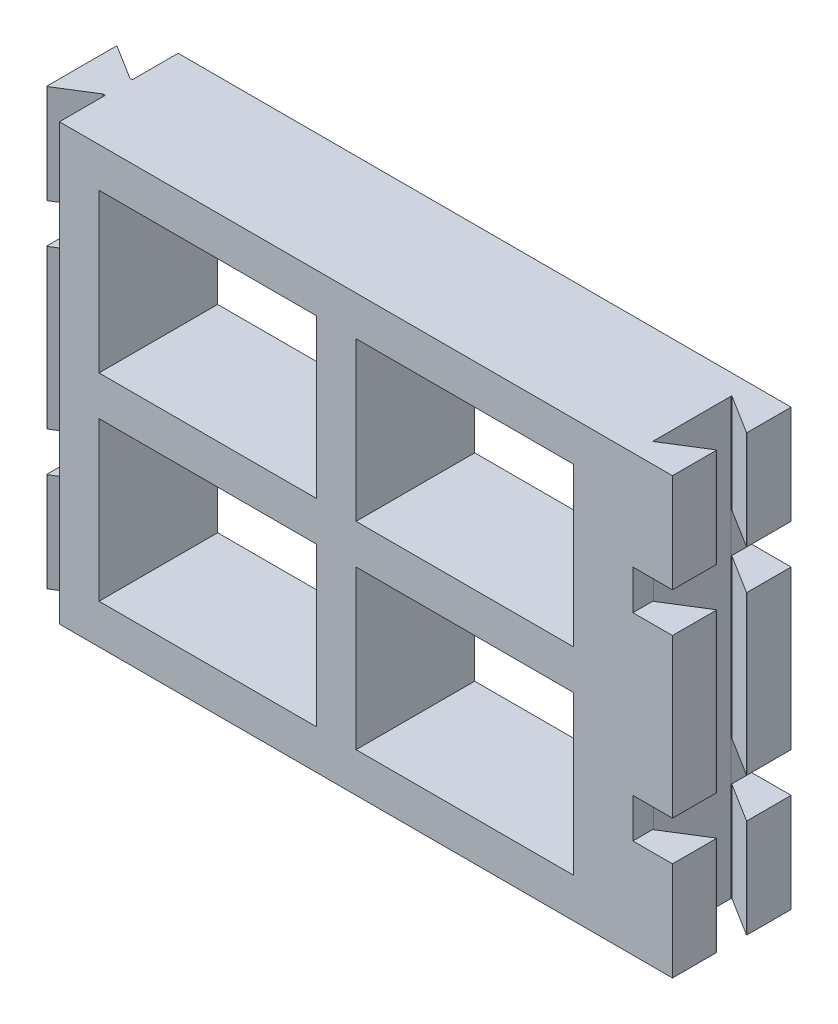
ISO-10303-21;
HEADER;
FILE_DESCRIPTION(('STEP AP214'),'2;1');
FILE_NAME('part.step','',(''),(''),'','','');
FILE_SCHEMA(('AUTOMOTIVE_DESIGN { 1 0 10303 214 1 1 1 1 }'));
ENDSEC;
DATA;
#1=APPLICATION_CONTEXT('core data for automotive mechanical design processes');
#2=APPLICATION_PROTOCOL_DEFINITION('international standard','automotive_design',2000,#1);
#3=PRODUCT_CONTEXT('',#1,'mechanical');
#4=PRODUCT('Part','Part','',(#3));
#5=PRODUCT_RELATED_PRODUCT_CATEGORY('part','',(#4));
#6=PRODUCT_DEFINITION_FORMATION('','',#4);
#7=PRODUCT_DEFINITION_CONTEXT('part definition',#1,'design');
#8=PRODUCT_DEFINITION('design','',#6,#7);
#9=PRODUCT_DEFINITION_SHAPE('','',#8);
#10=(LENGTH_UNIT() NAMED_UNIT(*) SI_UNIT(.MILLI.,.METRE.));
#11=(NAMED_UNIT(*) PLANE_ANGLE_UNIT() SI_UNIT($,.RADIAN.));
#12=(NAMED_UNIT(*) SI_UNIT($,.STERADIAN.) SOLID_ANGLE_UNIT());
#13=UNCERTAINTY_MEASURE_WITH_UNIT(LENGTH_MEASURE(1.E-05),#10,'distance_accuracy_value','');
#14=(GEOMETRIC_REPRESENTATION_CONTEXT(3) GLOBAL_UNCERTAINTY_ASSIGNED_CONTEXT((#13)) GLOBAL_UNIT_ASSIGNED_CONTEXT((#10,
#11,#12)) REPRESENTATION_CONTEXT('',''));
#15=CARTESIAN_POINT('',(0.,0.,0.));
#16=DIRECTION('',(0.,0.,1.));
#17=DIRECTION('',(1.,0.,0.));
#18=AXIS2_PLACEMENT_3D('',#15,#16,#17);
#19=CARTESIAN_POINT('',(155.,0.,30.));
#20=DIRECTION('',(-1.,0.,0.));
#21=DIRECTION('',(0.,0.,1.));
#22=AXIS2_PLACEMENT_3D('',#19,#20,#21);
#23=PLANE('',#22);
#24=DIRECTION('',(0.,-1.,0.));
#25=VECTOR('',#24,1.);
#26=CARTESIAN_POINT('',(155.,0.,18.9304047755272));
#27=LINE('',#26,#25);
#28=CARTESIAN_POINT('',(155.,-75.,18.9304047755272));
#29=VERTEX_POINT('',#28);
#30=CARTESIAN_POINT('',(155.,-35.,18.9304047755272));
#31=VERTEX_POINT('',#30);
#32=EDGE_CURVE('E623',#29,#31,#27,.F.);
#33=ORIENTED_EDGE('',*,*,#32,.T.);
#34=DIRECTION('',(0.,0.,1.));
#35=VECTOR('',#34,1.);
#36=CARTESIAN_POINT('',(155.,-35.,-20.));
#37=LINE('',#36,#35);
#38=CARTESIAN_POINT('',(155.,-35.,30.));
#39=VERTEX_POINT('',#38);
#40=EDGE_CURVE('E750',#31,#39,#37,.T.);
#41=ORIENTED_EDGE('',*,*,#40,.T.);
#42=DIRECTION('',(0.,1.,0.));
#43=VECTOR('',#42,1.);
#44=CARTESIAN_POINT('',(155.,0.,30.));
#45=LINE('',#44,#43);
#46=CARTESIAN_POINT('',(155.,-75.,30.));
#47=VERTEX_POINT('',#46);
#48=EDGE_CURVE('E544',#47,#39,#45,.T.);
#49=ORIENTED_EDGE('',*,*,#48,.F.);
#50=DIRECTION('',(0.,0.,1.));
#51=VECTOR('',#50,1.);
#52=CARTESIAN_POINT('',(155.,-75.,-20.));
#53=LINE('',#52,#51);
#54=EDGE_CURVE('E776',#29,#47,#53,.T.);
#55=ORIENTED_EDGE('',*,*,#54,.F.);
#56=EDGE_LOOP('',(#33,#41,#49,#55));
#57=FACE_BOUND('',#56,.T.);
#58=ADVANCED_FACE('F40',(#57),#23,.F.);
#59=CARTESIAN_POINT('',(155.,-110.,18.9304047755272));
#60=VERTEX_POINT('',#59);
#61=CARTESIAN_POINT('',(155.,-85.,18.9304047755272));
#62=VERTEX_POINT('',#61);
#63=EDGE_CURVE('E618',#60,#62,#27,.F.);
#64=ORIENTED_EDGE('',*,*,#63,.T.);
#65=DIRECTION('',(0.,0.,1.));
#66=VECTOR('',#65,1.);
#67=CARTESIAN_POINT('',(155.,-85.,-20.));
#68=LINE('',#67,#66);
#69=CARTESIAN_POINT('',(155.,-85.,30.));
#70=VERTEX_POINT('',#69);
#71=EDGE_CURVE('E777',#62,#70,#68,.T.);
#72=ORIENTED_EDGE('',*,*,#71,.T.);
#73=CARTESIAN_POINT('',(155.,-110.,30.));
#74=VERTEX_POINT('',#73);
#75=EDGE_CURVE('E547',#74,#70,#45,.T.);
#76=ORIENTED_EDGE('',*,*,#75,.F.);
#77=DIRECTION('',(0.,0.,-1.));
#78=VECTOR('',#77,1.);
#79=CARTESIAN_POINT('',(155.,-110.,30.));
#80=LINE('',#79,#78);
#81=EDGE_CURVE('E590',#74,#60,#80,.T.);
#82=ORIENTED_EDGE('',*,*,#81,.T.);
#83=EDGE_LOOP('',(#64,#72,#76,#82));
#84=FACE_BOUND('',#83,.T.);
#85=ADVANCED_FACE('F1424',(#84),#23,.F.);
#86=DIRECTION('',(0.,1.,0.));
#87=VECTOR('',#86,1.);
#88=CARTESIAN_POINT('',(155.,0.,0.));
#89=LINE('',#88,#87);
#90=CARTESIAN_POINT('',(155.,-75.,0.));
#91=VERTEX_POINT('',#90);
#92=CARTESIAN_POINT('',(155.,-35.,0.));
#93=VERTEX_POINT('',#92);
#94=EDGE_CURVE('E580',#91,#93,#89,.T.);
#95=ORIENTED_EDGE('',*,*,#94,.T.);
#96=CARTESIAN_POINT('',(155.,-35.,11.0695952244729));
#97=VERTEX_POINT('',#96);
#98=EDGE_CURVE('E769',#93,#97,#37,.T.);
#99=ORIENTED_EDGE('',*,*,#98,.T.);
#100=DIRECTION('',(0.,-1.,0.));
#101=VECTOR('',#100,1.);
#102=CARTESIAN_POINT('',(155.,-110.,11.0695952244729));
#103=LINE('',#102,#101);
#104=CARTESIAN_POINT('',(155.,-75.,11.0695952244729));
#105=VERTEX_POINT('',#104);
#106=EDGE_CURVE('E635',#97,#105,#103,.T.);
#107=ORIENTED_EDGE('',*,*,#106,.T.);
#108=EDGE_CURVE('E790',#91,#105,#53,.T.);
#109=ORIENTED_EDGE('',*,*,#108,.F.);
#110=EDGE_LOOP('',(#95,#99,#107,#109));
#111=FACE_BOUND('',#110,.T.);
#112=ADVANCED_FACE('F1378',(#111),#23,.F.);
#113=CARTESIAN_POINT('',(155.,-110.,0.));
#114=VERTEX_POINT('',#113);
#115=CARTESIAN_POINT('',(155.,-85.,0.));
#116=VERTEX_POINT('',#115);
#117=EDGE_CURVE('E575',#114,#116,#89,.T.);
#118=ORIENTED_EDGE('',*,*,#117,.T.);
#119=CARTESIAN_POINT('',(155.,-85.,11.0695952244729));
#120=VERTEX_POINT('',#119);
#121=EDGE_CURVE('E781',#116,#120,#68,.T.);
#122=ORIENTED_EDGE('',*,*,#121,.T.);
#123=CARTESIAN_POINT('',(155.,-110.,11.0695952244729));
#124=VERTEX_POINT('',#123);
#125=EDGE_CURVE('E629',#120,#124,#103,.T.);
#126=ORIENTED_EDGE('',*,*,#125,.T.);
#127=EDGE_CURVE('E589',#124,#114,#80,.T.);
#128=ORIENTED_EDGE('',*,*,#127,.T.);
#129=EDGE_LOOP('',(#118,#122,#126,#128));
#130=FACE_BOUND('',#129,.T.);
#131=ADVANCED_FACE('F1330',(#130),#23,.F.);
#132=CARTESIAN_POINT('',(-9.40209080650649,0.,0.));
#133=DIRECTION('',(1.,0.,0.));
#134=DIRECTION('',(0.,0.,-1.));
#135=AXIS2_PLACEMENT_3D('',#132,#133,#134);
#136=PLANE('',#135);
#137=DIRECTION('',(0.,-1.,0.));
#138=VECTOR('',#137,1.);
#139=CARTESIAN_POINT('',(-9.40209080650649,0.,23.737166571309));
#140=LINE('',#139,#138);
#141=CARTESIAN_POINT('',(-9.40209080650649,-110.,23.737166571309));
#142=VERTEX_POINT('',#141);
#143=CARTESIAN_POINT('',(-9.40209080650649,-85.0000000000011,23.737166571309));
#144=VERTEX_POINT('',#143);
#145=EDGE_CURVE('E685',#142,#144,#140,.F.);
#146=ORIENTED_EDGE('',*,*,#145,.T.);
#147=DIRECTION('',(0.,0.,-1.));
#148=VECTOR('',#147,1.);
#149=CARTESIAN_POINT('',(-9.40209080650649,-85.0000000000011,0.));
#150=LINE('',#149,#148);
#151=CARTESIAN_POINT('',(-9.40209080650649,-85.0000000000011,6.26283342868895));
#152=VERTEX_POINT('',#151);
#153=EDGE_CURVE('E863',#144,#152,#150,.T.);
#154=ORIENTED_EDGE('',*,*,#153,.T.);
#155=DIRECTION('',(0.,-1.,0.));
#156=VECTOR('',#155,1.);
#157=CARTESIAN_POINT('',(-9.40209080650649,0.,6.26283342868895));
#158=LINE('',#157,#156);
#159=CARTESIAN_POINT('',(-9.40209080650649,-110.,6.26283342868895));
#160=VERTEX_POINT('',#159);
#161=EDGE_CURVE('E678',#152,#160,#158,.T.);
#162=ORIENTED_EDGE('',*,*,#161,.T.);
#163=DIRECTION('',(0.,0.,1.));
#164=VECTOR('',#163,1.);
#165=CARTESIAN_POINT('',(-9.40209080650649,-110.,0.));
#166=LINE('',#165,#164);
#167=EDGE_CURVE('E982',#160,#142,#166,.T.);
#168=ORIENTED_EDGE('',*,*,#167,.T.);
#169=EDGE_LOOP('',(#146,#154,#162,#168));
#170=FACE_BOUND('',#169,.T.);
#171=ADVANCED_FACE('F1258',(#170),#136,.F.);
#172=CARTESIAN_POINT('',(-9.40209080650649,0.,6.26283342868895));
#173=VERTEX_POINT('',#172);
#174=CARTESIAN_POINT('',(-9.40209080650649,-25.0000000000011,6.26283342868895));
#175=VERTEX_POINT('',#174);
#176=EDGE_CURVE('E679',#173,#175,#158,.T.);
#177=ORIENTED_EDGE('',*,*,#176,.T.);
#178=DIRECTION('',(0.,0.,1.));
#179=VECTOR('',#178,1.);
#180=CARTESIAN_POINT('',(-9.40209080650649,-25.0000000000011,0.));
#181=LINE('',#180,#179);
#182=CARTESIAN_POINT('',(-9.40209080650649,-25.0000000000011,23.737166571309));
#183=VERTEX_POINT('',#182);
#184=EDGE_CURVE('E821',#175,#183,#181,.T.);
#185=ORIENTED_EDGE('',*,*,#184,.T.);
#186=CARTESIAN_POINT('',(-9.40209080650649,0.,23.737166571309));
#187=VERTEX_POINT('',#186);
#188=EDGE_CURVE('E683',#183,#187,#140,.F.);
#189=ORIENTED_EDGE('',*,*,#188,.T.);
#190=DIRECTION('',(0.,0.,1.));
#191=VECTOR('',#190,1.);
#192=CARTESIAN_POINT('',(-9.40209080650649,0.,0.));
#193=LINE('',#192,#191);
#194=EDGE_CURVE('E993',#173,#187,#193,.T.);
#195=ORIENTED_EDGE('',*,*,#194,.F.);
#196=EDGE_LOOP('',(#177,#185,#189,#195));
#197=FACE_BOUND('',#196,.T.);
#198=ADVANCED_FACE('F1511',(#197),#136,.F.);
#199=CARTESIAN_POINT('',(8.10824262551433,0.,12.9759006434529));
#200=DIRECTION('',(-0.529919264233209,0.,-0.848048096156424));
#201=DIRECTION('',(-0.848048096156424,0.,0.529919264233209));
#202=AXIS2_PLACEMENT_3D('',#199,#200,#201);
#203=PLANE('',#202);
#204=DIRECTION('',(0.,-1.,0.));
#205=VECTOR('',#204,1.);
#206=CARTESIAN_POINT('',(-0.6,0.,18.4174145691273));
#207=LINE('',#206,#205);
#208=CARTESIAN_POINT('',(-0.6,-85.0000000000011,18.4174145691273));
#209=VERTEX_POINT('',#208);
#210=CARTESIAN_POINT('',(-0.6,-110.,18.4174145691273));
#211=VERTEX_POINT('',#210);
#212=EDGE_CURVE('E1037',#209,#211,#207,.T.);
#213=ORIENTED_EDGE('',*,*,#212,.F.);
#214=DIRECTION('',(-0.848048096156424,0.,0.529919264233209));
#215=VECTOR('',#214,1.);
#216=CARTESIAN_POINT('',(8.10824262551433,-85.0000000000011,12.9759006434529));
#217=LINE('',#216,#215);
#218=CARTESIAN_POINT('',(-9.24909888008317,-85.0000000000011,23.8219713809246));
#219=VERTEX_POINT('',#218);
#220=EDGE_CURVE('E870',#209,#219,#217,.T.);
#221=ORIENTED_EDGE('',*,*,#220,.T.);
#222=DIRECTION('',(0.,-1.,0.));
#223=VECTOR('',#222,1.);
#224=CARTESIAN_POINT('',(-9.24909888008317,0.,23.8219713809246));
#225=LINE('',#224,#223);
#226=CARTESIAN_POINT('',(-9.24909888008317,-110.,23.8219713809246));
#227=VERTEX_POINT('',#226);
#228=EDGE_CURVE('E666',#219,#227,#225,.T.);
#229=ORIENTED_EDGE('',*,*,#228,.T.);
#230=DIRECTION('',(0.848048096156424,0.,-0.529919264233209));
#231=VECTOR('',#230,1.);
#232=CARTESIAN_POINT('',(8.10824262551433,-110.,12.9759006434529));
#233=LINE('',#232,#231);
#234=EDGE_CURVE('E998',#227,#211,#233,.T.);
#235=ORIENTED_EDGE('',*,*,#234,.T.);
#236=EDGE_LOOP('',(#213,#221,#229,#235));
#237=FACE_BOUND('',#236,.T.);
#238=ADVANCED_FACE('F1250',(#237),#203,.F.);
#239=CARTESIAN_POINT('',(-9.24909888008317,0.,23.8219713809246));
#240=VERTEX_POINT('',#239);
#241=CARTESIAN_POINT('',(-9.24909888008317,-25.0000000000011,23.8219713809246));
#242=VERTEX_POINT('',#241);
#243=EDGE_CURVE('E667',#240,#242,#225,.T.);
#244=ORIENTED_EDGE('',*,*,#243,.T.);
#245=DIRECTION('',(0.848048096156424,0.,-0.529919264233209));
#246=VECTOR('',#245,1.);
#247=CARTESIAN_POINT('',(8.10824262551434,-25.0000000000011,12.9759006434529));
#248=LINE('',#247,#246);
#249=CARTESIAN_POINT('',(-0.6,-25.0000000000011,18.4174145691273));
#250=VERTEX_POINT('',#249);
#251=EDGE_CURVE('E828',#242,#250,#248,.T.);
#252=ORIENTED_EDGE('',*,*,#251,.T.);
#253=CARTESIAN_POINT('',(-0.6,0.,18.4174145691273));
#254=VERTEX_POINT('',#253);
#255=EDGE_CURVE('E1031',#254,#250,#207,.T.);
#256=ORIENTED_EDGE('',*,*,#255,.F.);
#257=DIRECTION('',(0.848048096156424,0.,-0.529919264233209));
#258=VECTOR('',#257,1.);
#259=CARTESIAN_POINT('',(8.10824262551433,0.,12.9759006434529));
#260=LINE('',#259,#258);
#261=EDGE_CURVE('E1009',#240,#254,#260,.T.);
#262=ORIENTED_EDGE('',*,*,#261,.F.);
#263=EDGE_LOOP('',(#244,#252,#256,#262));
#264=FACE_BOUND('',#263,.T.);
#265=ADVANCED_FACE('F1504',(#264),#203,.F.);
#266=CARTESIAN_POINT('',(0.,0.,18.4174145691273));
#267=DIRECTION('',(0.,0.,1.));
#268=DIRECTION('',(1.,0.,0.));
#269=AXIS2_PLACEMENT_3D('',#266,#267,#268);
#270=PLANE('',#269);
#271=DIRECTION('',(1.,0.,0.));
#272=VECTOR('',#271,1.);
#273=CARTESIAN_POINT('',(0.,-85.0000000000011,18.4174145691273));
#274=LINE('',#273,#272);
#275=CARTESIAN_POINT('',(0.,-85.0000000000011,18.4174145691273));
#276=VERTEX_POINT('',#275);
#277=EDGE_CURVE('E874',#209,#276,#274,.T.);
#278=ORIENTED_EDGE('',*,*,#277,.F.);
#279=ORIENTED_EDGE('',*,*,#212,.T.);
#280=DIRECTION('',(-1.,0.,0.));
#281=VECTOR('',#280,1.);
#282=CARTESIAN_POINT('',(0.,-110.,18.4174145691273));
#283=LINE('',#282,#281);
#284=CARTESIAN_POINT('',(0.,-110.,18.4174145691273));
#285=VERTEX_POINT('',#284);
#286=EDGE_CURVE('E1024',#285,#211,#283,.T.);
#287=ORIENTED_EDGE('',*,*,#286,.F.);
#288=DIRECTION('',(0.,-1.,0.));
#289=VECTOR('',#288,1.);
#290=CARTESIAN_POINT('',(0.,0.,18.4174145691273));
#291=LINE('',#290,#289);
#292=EDGE_CURVE('E1043',#276,#285,#291,.T.);
#293=ORIENTED_EDGE('',*,*,#292,.F.);
#294=EDGE_LOOP('',(#278,#279,#287,#293));
#295=FACE_BOUND('',#294,.T.);
#296=ADVANCED_FACE('F1245',(#295),#270,.T.);
#297=DIRECTION('',(-1.,0.,0.));
#298=VECTOR('',#297,1.);
#299=CARTESIAN_POINT('',(0.,-25.0000000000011,18.4174145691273));
#300=LINE('',#299,#298);
#301=CARTESIAN_POINT('',(0.,-25.0000000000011,18.4174145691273));
#302=VERTEX_POINT('',#301);
#303=EDGE_CURVE('E832',#302,#250,#300,.T.);
#304=ORIENTED_EDGE('',*,*,#303,.F.);
#305=CARTESIAN_POINT('',(0.,0.,18.4174145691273));
#306=VERTEX_POINT('',#305);
#307=EDGE_CURVE('E1038',#306,#302,#291,.T.);
#308=ORIENTED_EDGE('',*,*,#307,.F.);
#309=DIRECTION('',(-1.,0.,0.));
#310=VECTOR('',#309,1.);
#311=CARTESIAN_POINT('',(0.,0.,18.4174145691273));
#312=LINE('',#311,#310);
#313=EDGE_CURVE('E1005',#306,#254,#312,.T.);
#314=ORIENTED_EDGE('',*,*,#313,.T.);
#315=ORIENTED_EDGE('',*,*,#255,.T.);
#316=EDGE_LOOP('',(#304,#308,#314,#315));
#317=FACE_BOUND('',#316,.T.);
#318=ADVANCED_FACE('F1651',(#317),#270,.T.);
#319=CARTESIAN_POINT('',(0.,0.,11.5825854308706));
#320=DIRECTION('',(0.,0.,-1.));
#321=DIRECTION('',(-1.,0.,0.));
#322=AXIS2_PLACEMENT_3D('',#319,#320,#321);
#323=PLANE('',#322);
#324=DIRECTION('',(-1.,0.,0.));
#325=VECTOR('',#324,1.);
#326=CARTESIAN_POINT('',(0.,-85.0000000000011,11.5825854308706));
#327=LINE('',#326,#325);
#328=CARTESIAN_POINT('',(0.,-85.0000000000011,11.5825854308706));
#329=VERTEX_POINT('',#328);
#330=CARTESIAN_POINT('',(-0.6,-85.0000000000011,11.5825854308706));
#331=VERTEX_POINT('',#330);
#332=EDGE_CURVE('E860',#329,#331,#327,.T.);
#333=ORIENTED_EDGE('',*,*,#332,.F.);
#334=DIRECTION('',(0.,-1.,0.));
#335=VECTOR('',#334,1.);
#336=CARTESIAN_POINT('',(0.,0.,11.5825854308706));
#337=LINE('',#336,#335);
#338=CARTESIAN_POINT('',(0.,-110.,11.5825854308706));
#339=VERTEX_POINT('',#338);
#340=EDGE_CURVE('E1049',#329,#339,#337,.T.);
#341=ORIENTED_EDGE('',*,*,#340,.T.);
#342=DIRECTION('',(1.,0.,0.));
#343=VECTOR('',#342,1.);
#344=CARTESIAN_POINT('',(0.,-110.,11.5825854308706));
#345=LINE('',#344,#343);
#346=CARTESIAN_POINT('',(-0.6,-110.,11.5825854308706));
#347=VERTEX_POINT('',#346);
#348=EDGE_CURVE('E1020',#347,#339,#345,.T.);
#349=ORIENTED_EDGE('',*,*,#348,.F.);
#350=DIRECTION('',(0.,-1.,0.));
#351=VECTOR('',#350,1.);
#352=CARTESIAN_POINT('',(-0.6,0.,11.5825854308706));
#353=LINE('',#352,#351);
#354=EDGE_CURVE('E1012',#331,#347,#353,.T.);
#355=ORIENTED_EDGE('',*,*,#354,.F.);
#356=EDGE_LOOP('',(#333,#341,#349,#355));
#357=FACE_BOUND('',#356,.T.);
#358=ADVANCED_FACE('F1274',(#357),#323,.T.);
#359=DIRECTION('',(1.,0.,0.));
#360=VECTOR('',#359,1.);
#361=CARTESIAN_POINT('',(0.,-25.0000000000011,11.5825854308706));
#362=LINE('',#361,#360);
#363=CARTESIAN_POINT('',(-0.6,-25.0000000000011,11.5825854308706));
#364=VERTEX_POINT('',#363);
#365=CARTESIAN_POINT('',(0.,-25.0000000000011,11.5825854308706));
#366=VERTEX_POINT('',#365);
#367=EDGE_CURVE('E818',#364,#366,#362,.T.);
#368=ORIENTED_EDGE('',*,*,#367,.F.);
#369=CARTESIAN_POINT('',(-0.6,0.,11.5825854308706));
#370=VERTEX_POINT('',#369);
#371=EDGE_CURVE('E1050',#370,#364,#353,.T.);
#372=ORIENTED_EDGE('',*,*,#371,.F.);
#373=DIRECTION('',(1.,0.,0.));
#374=VECTOR('',#373,1.);
#375=CARTESIAN_POINT('',(0.,0.,11.5825854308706));
#376=LINE('',#375,#374);
#377=CARTESIAN_POINT('',(0.,0.,11.5825854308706));
#378=VERTEX_POINT('',#377);
#379=EDGE_CURVE('E1002',#370,#378,#376,.T.);
#380=ORIENTED_EDGE('',*,*,#379,.T.);
#381=EDGE_CURVE('E1044',#378,#366,#337,.T.);
#382=ORIENTED_EDGE('',*,*,#381,.T.);
#383=EDGE_LOOP('',(#368,#372,#380,#382));
#384=FACE_BOUND('',#383,.T.);
#385=ADVANCED_FACE('F1520',(#384),#323,.T.);
#386=CARTESIAN_POINT('',(-5.37366806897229,0.,8.59966655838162));
#387=DIRECTION('',(-0.529919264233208,0.,0.848048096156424));
#388=DIRECTION('',(0.848048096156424,0.,0.529919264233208));
#389=AXIS2_PLACEMENT_3D('',#386,#387,#388);
#390=PLANE('',#389);
#391=DIRECTION('',(0.,-1.,0.));
#392=VECTOR('',#391,1.);
#393=CARTESIAN_POINT('',(-9.24909888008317,0.,6.17802861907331));
#394=LINE('',#393,#392);
#395=CARTESIAN_POINT('',(-9.24909888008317,-110.,6.1780286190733));
#396=VERTEX_POINT('',#395);
#397=CARTESIAN_POINT('',(-9.24909888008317,-85.0000000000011,6.1780286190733));
#398=VERTEX_POINT('',#397);
#399=EDGE_CURVE('E697',#396,#398,#394,.F.);
#400=ORIENTED_EDGE('',*,*,#399,.T.);
#401=DIRECTION('',(0.848048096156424,0.,0.529919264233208));
#402=VECTOR('',#401,1.);
#403=CARTESIAN_POINT('',(-5.37366806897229,-85.0000000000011,8.59966655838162));
#404=LINE('',#403,#402);
#405=EDGE_CURVE('E856',#398,#331,#404,.T.);
#406=ORIENTED_EDGE('',*,*,#405,.T.);
#407=ORIENTED_EDGE('',*,*,#354,.T.);
#408=DIRECTION('',(-0.848048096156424,0.,-0.529919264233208));
#409=VECTOR('',#408,1.);
#410=CARTESIAN_POINT('',(-5.37366806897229,-110.,8.59966655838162));
#411=LINE('',#410,#409);
#412=EDGE_CURVE('E1016',#347,#396,#411,.T.);
#413=ORIENTED_EDGE('',*,*,#412,.T.);
#414=EDGE_LOOP('',(#400,#406,#407,#413));
#415=FACE_BOUND('',#414,.T.);
#416=ADVANCED_FACE('F1266',(#415),#390,.F.);
#417=ORIENTED_EDGE('',*,*,#371,.T.);
#418=DIRECTION('',(-0.848048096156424,0.,-0.529919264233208));
#419=VECTOR('',#418,1.);
#420=CARTESIAN_POINT('',(-5.37366806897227,-25.0000000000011,8.59966655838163));
#421=LINE('',#420,#419);
#422=CARTESIAN_POINT('',(-9.24909888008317,-25.0000000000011,6.1780286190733));
#423=VERTEX_POINT('',#422);
#424=EDGE_CURVE('E814',#364,#423,#421,.T.);
#425=ORIENTED_EDGE('',*,*,#424,.T.);
#426=CARTESIAN_POINT('',(-9.24909888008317,0.,6.1780286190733));
#427=VERTEX_POINT('',#426);
#428=EDGE_CURVE('E696',#423,#427,#394,.F.);
#429=ORIENTED_EDGE('',*,*,#428,.T.);
#430=DIRECTION('',(-0.848048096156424,0.,-0.529919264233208));
#431=VECTOR('',#430,1.);
#432=CARTESIAN_POINT('',(-5.37366806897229,0.,8.59966655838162));
#433=LINE('',#432,#431);
#434=EDGE_CURVE('E997',#370,#427,#433,.T.);
#435=ORIENTED_EDGE('',*,*,#434,.F.);
#436=EDGE_LOOP('',(#417,#425,#429,#435));
#437=FACE_BOUND('',#436,.T.);
#438=ADVANCED_FACE('F1516',(#437),#390,.F.);
#439=CARTESIAN_POINT('',(51.952430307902,0.,83.1412680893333));
#440=DIRECTION('',(-0.52991926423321,0.,-0.848048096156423));
#441=DIRECTION('',(-0.848048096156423,0.,0.52991926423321));
#442=AXIS2_PLACEMENT_3D('',#439,#440,#441);
#443=PLANE('',#442);
#444=DIRECTION('',(-0.848048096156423,0.,0.52991926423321));
#445=VECTOR('',#444,1.);
#446=CARTESIAN_POINT('',(51.952430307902,-35.,83.1412680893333));
#447=LINE('',#446,#445);
#448=CARTESIAN_POINT('',(154.847008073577,-35.,18.8455999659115));
#449=VERTEX_POINT('',#448);
#450=CARTESIAN_POINT('',(145.150901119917,-35.,24.9044000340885));
#451=VERTEX_POINT('',#450);
#452=EDGE_CURVE('E948',#449,#451,#447,.T.);
#453=ORIENTED_EDGE('',*,*,#452,.F.);
#454=DIRECTION('',(0.,-1.,0.));
#455=VECTOR('',#454,1.);
#456=CARTESIAN_POINT('',(154.847008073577,-110.,18.8455999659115));
#457=LINE('',#456,#455);
#458=CARTESIAN_POINT('',(154.847008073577,-75.,18.8455999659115));
#459=VERTEX_POINT('',#458);
#460=EDGE_CURVE('E611',#449,#459,#457,.T.);
#461=ORIENTED_EDGE('',*,*,#460,.T.);
#462=DIRECTION('',(0.848048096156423,0.,-0.52991926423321));
#463=VECTOR('',#462,1.);
#464=CARTESIAN_POINT('',(51.952430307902,-75.,83.1412680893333));
#465=LINE('',#464,#463);
#466=CARTESIAN_POINT('',(145.150901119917,-75.,24.9044000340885));
#467=VERTEX_POINT('',#466);
#468=EDGE_CURVE('E877',#467,#459,#465,.T.);
#469=ORIENTED_EDGE('',*,*,#468,.F.);
#470=DIRECTION('',(0.,-1.,0.));
#471=VECTOR('',#470,1.);
#472=CARTESIAN_POINT('',(145.150901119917,0.,24.9044000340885));
#473=LINE('',#472,#471);
#474=EDGE_CURVE('E605',#467,#451,#473,.F.);
#475=ORIENTED_EDGE('',*,*,#474,.T.);
#476=EDGE_LOOP('',(#453,#461,#469,#475));
#477=FACE_BOUND('',#476,.T.);
#478=ADVANCED_FACE('F1433',(#477),#443,.T.);
#479=DIRECTION('',(-0.848048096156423,0.,0.52991926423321));
#480=VECTOR('',#479,1.);
#481=CARTESIAN_POINT('',(51.952430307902,-85.,83.1412680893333));
#482=LINE('',#481,#480);
#483=CARTESIAN_POINT('',(154.847008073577,-85.,18.8455999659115));
#484=VERTEX_POINT('',#483);
#485=CARTESIAN_POINT('',(145.150901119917,-85.,24.9044000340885));
#486=VERTEX_POINT('',#485);
#487=EDGE_CURVE('E903',#484,#486,#482,.T.);
#488=ORIENTED_EDGE('',*,*,#487,.F.);
#489=CARTESIAN_POINT('',(154.847008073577,-110.,18.8455999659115));
#490=VERTEX_POINT('',#489);
#491=EDGE_CURVE('E604',#484,#490,#457,.T.);
#492=ORIENTED_EDGE('',*,*,#491,.T.);
#493=DIRECTION('',(0.848048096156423,0.,-0.529919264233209));
#494=VECTOR('',#493,1.);
#495=CARTESIAN_POINT('',(51.952430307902,-110.,83.1412680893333));
#496=LINE('',#495,#494);
#497=CARTESIAN_POINT('',(145.150901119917,-110.,24.9044000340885));
#498=VERTEX_POINT('',#497);
#499=EDGE_CURVE('E968',#498,#490,#496,.T.);
#500=ORIENTED_EDGE('',*,*,#499,.F.);
#501=EDGE_CURVE('E600',#498,#486,#473,.F.);
#502=ORIENTED_EDGE('',*,*,#501,.T.);
#503=EDGE_LOOP('',(#488,#492,#500,#502));
#504=FACE_BOUND('',#503,.T.);
#505=ADVANCED_FACE('F1415',(#504),#443,.T.);
#506=CARTESIAN_POINT('',(38.4705196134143,0.,-61.5657008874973));
#507=DIRECTION('',(-0.529919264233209,0.,0.848048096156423));
#508=DIRECTION('',(0.848048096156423,0.,0.529919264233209));
#509=AXIS2_PLACEMENT_3D('',#506,#507,#508);
#510=PLANE('',#509);
#511=DIRECTION('',(0.848048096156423,0.,0.529919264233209));
#512=VECTOR('',#511,1.);
#513=CARTESIAN_POINT('',(38.4705196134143,-35.,-61.5657008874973));
#514=LINE('',#513,#512);
#515=CARTESIAN_POINT('',(145.150901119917,-35.,5.0955999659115));
#516=VERTEX_POINT('',#515);
#517=CARTESIAN_POINT('',(154.847008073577,-35.,11.1544000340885));
#518=VERTEX_POINT('',#517);
#519=EDGE_CURVE('E958',#516,#518,#514,.T.);
#520=ORIENTED_EDGE('',*,*,#519,.F.);
#521=DIRECTION('',(0.,-1.,0.));
#522=VECTOR('',#521,1.);
#523=CARTESIAN_POINT('',(145.150901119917,-110.,5.0955999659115));
#524=LINE('',#523,#522);
#525=CARTESIAN_POINT('',(145.150901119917,-75.,5.0955999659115));
#526=VERTEX_POINT('',#525);
#527=EDGE_CURVE('E641',#516,#526,#524,.T.);
#528=ORIENTED_EDGE('',*,*,#527,.T.);
#529=DIRECTION('',(-0.848048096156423,0.,-0.529919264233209));
#530=VECTOR('',#529,1.);
#531=CARTESIAN_POINT('',(38.4705196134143,-75.,-61.5657008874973));
#532=LINE('',#531,#530);
#533=CARTESIAN_POINT('',(154.847008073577,-75.,11.1544000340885));
#534=VERTEX_POINT('',#533);
#535=EDGE_CURVE('E56',#534,#526,#532,.T.);
#536=ORIENTED_EDGE('',*,*,#535,.F.);
#537=DIRECTION('',(0.,-1.,0.));
#538=VECTOR('',#537,1.);
#539=CARTESIAN_POINT('',(154.847008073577,0.,11.1544000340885));
#540=LINE('',#539,#538);
#541=EDGE_CURVE('E647',#534,#518,#540,.F.);
#542=ORIENTED_EDGE('',*,*,#541,.T.);
#543=EDGE_LOOP('',(#520,#528,#536,#542));
#544=FACE_BOUND('',#543,.T.);
#545=ADVANCED_FACE('F1365',(#544),#510,.T.);
#546=DIRECTION('',(0.848048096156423,0.,0.529919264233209));
#547=VECTOR('',#546,1.);
#548=CARTESIAN_POINT('',(38.4705196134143,-85.,-61.5657008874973));
#549=LINE('',#548,#547);
#550=CARTESIAN_POINT('',(145.150901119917,-85.,5.0955999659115));
#551=VERTEX_POINT('',#550);
#552=CARTESIAN_POINT('',(154.847008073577,-85.,11.1544000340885));
#553=VERTEX_POINT('',#552);
#554=EDGE_CURVE('E913',#551,#553,#549,.T.);
#555=ORIENTED_EDGE('',*,*,#554,.F.);
#556=CARTESIAN_POINT('',(145.150901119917,-110.,5.09559996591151));
#557=VERTEX_POINT('',#556);
#558=EDGE_CURVE('E634',#551,#557,#524,.T.);
#559=ORIENTED_EDGE('',*,*,#558,.T.);
#560=DIRECTION('',(-0.848048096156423,0.,-0.529919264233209));
#561=VECTOR('',#560,1.);
#562=CARTESIAN_POINT('',(38.4705196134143,-110.,-61.5657008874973));
#563=LINE('',#562,#561);
#564=CARTESIAN_POINT('',(154.847008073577,-110.,11.1544000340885));
#565=VERTEX_POINT('',#564);
#566=EDGE_CURVE('E974',#565,#557,#563,.T.);
#567=ORIENTED_EDGE('',*,*,#566,.F.);
#568=EDGE_CURVE('E642',#565,#553,#540,.F.);
#569=ORIENTED_EDGE('',*,*,#568,.T.);
#570=EDGE_LOOP('',(#555,#559,#567,#569));
#571=FACE_BOUND('',#570,.T.);
#572=ADVANCED_FACE('F1340',(#571),#510,.T.);
#573=CARTESIAN_POINT('',(154.9,0.,18.9304047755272));
#574=DIRECTION('',(0.,1.,0.));
#575=DIRECTION('',(0.,0.,1.));
#576=AXIS2_PLACEMENT_3D('',#573,#574,#575);
#577=CYLINDRICAL_SURFACE('',#576,0.1);
#578=CARTESIAN_POINT('',(154.9,-35.,18.9304047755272));
#579=DIRECTION('',(0.,-1.,0.));
#580=DIRECTION('',(0.,0.,-1.));
#581=AXIS2_PLACEMENT_3D('',#578,#579,#580);
#582=CIRCLE('',#581,0.1);
#583=EDGE_CURVE('E951',#31,#449,#582,.F.);
#584=ORIENTED_EDGE('',*,*,#583,.F.);
#585=ORIENTED_EDGE('',*,*,#32,.F.);
#586=CARTESIAN_POINT('',(154.9,-75.,18.9304047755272));
#587=DIRECTION('',(0.,1.,0.));
#588=DIRECTION('',(0.,0.,1.));
#589=AXIS2_PLACEMENT_3D('',#586,#587,#588);
#590=CIRCLE('',#589,0.1);
#591=EDGE_CURVE('E880',#459,#29,#590,.F.);
#592=ORIENTED_EDGE('',*,*,#591,.F.);
#593=ORIENTED_EDGE('',*,*,#460,.F.);
#594=EDGE_LOOP('',(#584,#585,#592,#593));
#595=FACE_BOUND('',#594,.T.);
#596=ADVANCED_FACE('F1397',(#595),#577,.T.);
#597=CARTESIAN_POINT('',(154.9,-85.,18.9304047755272));
#598=DIRECTION('',(0.,-1.,0.));
#599=DIRECTION('',(0.,0.,-1.));
#600=AXIS2_PLACEMENT_3D('',#597,#598,#599);
#601=CIRCLE('',#600,0.1);
#602=EDGE_CURVE('E906',#62,#484,#601,.F.);
#603=ORIENTED_EDGE('',*,*,#602,.F.);
#604=ORIENTED_EDGE('',*,*,#63,.F.);
#605=CARTESIAN_POINT('',(154.9,-110.,18.9304047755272));
#606=DIRECTION('',(0.,1.,0.));
#607=DIRECTION('',(0.,0.,1.));
#608=AXIS2_PLACEMENT_3D('',#605,#606,#607);
#609=CIRCLE('',#608,0.1);
#610=EDGE_CURVE('E614',#490,#60,#609,.F.);
#611=ORIENTED_EDGE('',*,*,#610,.F.);
#612=ORIENTED_EDGE('',*,*,#491,.F.);
#613=EDGE_LOOP('',(#603,#604,#611,#612));
#614=FACE_BOUND('',#613,.T.);
#615=ADVANCED_FACE('F1422',(#614),#577,.T.);
#616=CARTESIAN_POINT('',(154.9,0.,11.0695952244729));
#617=DIRECTION('',(0.,1.,0.));
#618=DIRECTION('',(0.,0.,1.));
#619=AXIS2_PLACEMENT_3D('',#616,#617,#618);
#620=CYLINDRICAL_SURFACE('',#619,0.1);
#621=CARTESIAN_POINT('',(154.9,-35.,11.0695952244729));
#622=DIRECTION('',(0.,-1.,0.));
#623=DIRECTION('',(0.,0.,-1.));
#624=AXIS2_PLACEMENT_3D('',#621,#622,#623);
#625=CIRCLE('',#624,0.1);
#626=EDGE_CURVE('E961',#518,#97,#625,.F.);
#627=ORIENTED_EDGE('',*,*,#626,.F.);
#628=ORIENTED_EDGE('',*,*,#541,.F.);
#629=CARTESIAN_POINT('',(154.9,-75.,11.0695952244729));
#630=DIRECTION('',(0.,1.,0.));
#631=DIRECTION('',(0.,0.,1.));
#632=AXIS2_PLACEMENT_3D('',#629,#630,#631);
#633=CIRCLE('',#632,0.1);
#634=EDGE_CURVE('E888',#105,#534,#633,.F.);
#635=ORIENTED_EDGE('',*,*,#634,.F.);
#636=ORIENTED_EDGE('',*,*,#106,.F.);
#637=EDGE_LOOP('',(#627,#628,#635,#636));
#638=FACE_BOUND('',#637,.T.);
#639=ADVANCED_FACE('F1370',(#638),#620,.T.);
#640=CARTESIAN_POINT('',(154.9,-85.,11.0695952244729));
#641=DIRECTION('',(0.,-1.,0.));
#642=DIRECTION('',(0.,0.,-1.));
#643=AXIS2_PLACEMENT_3D('',#640,#641,#642);
#644=CIRCLE('',#643,0.1);
#645=EDGE_CURVE('E916',#553,#120,#644,.F.);
#646=ORIENTED_EDGE('',*,*,#645,.F.);
#647=ORIENTED_EDGE('',*,*,#568,.F.);
#648=CARTESIAN_POINT('',(154.9,-110.,11.0695952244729));
#649=DIRECTION('',(0.,1.,0.));
#650=DIRECTION('',(0.,0.,1.));
#651=AXIS2_PLACEMENT_3D('',#648,#649,#650);
#652=CIRCLE('',#651,0.1);
#653=EDGE_CURVE('E610',#124,#565,#652,.F.);
#654=ORIENTED_EDGE('',*,*,#653,.F.);
#655=ORIENTED_EDGE('',*,*,#125,.F.);
#656=EDGE_LOOP('',(#646,#647,#654,#655));
#657=FACE_BOUND('',#656,.T.);
#658=ADVANCED_FACE('F1337',(#657),#620,.T.);
#659=CARTESIAN_POINT('',(-9.30209080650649,0.,23.737166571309));
#660=DIRECTION('',(0.,-1.,0.));
#661=DIRECTION('',(0.,0.,-1.));
#662=AXIS2_PLACEMENT_3D('',#659,#660,#661);
#663=CYLINDRICAL_SURFACE('',#662,0.1);
#664=CARTESIAN_POINT('',(-9.30209080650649,-85.0000000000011,23.737166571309));
#665=DIRECTION('',(0.,-1.,0.));
#666=DIRECTION('',(0.,0.,-1.));
#667=AXIS2_PLACEMENT_3D('',#664,#665,#666);
#668=CIRCLE('',#667,0.1);
#669=EDGE_CURVE('E867',#144,#219,#668,.F.);
#670=ORIENTED_EDGE('',*,*,#669,.F.);
#671=ORIENTED_EDGE('',*,*,#145,.F.);
#672=CARTESIAN_POINT('',(-9.30209080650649,-110.,23.737166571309));
#673=DIRECTION('',(0.,1.,0.));
#674=DIRECTION('',(0.,0.,1.));
#675=AXIS2_PLACEMENT_3D('',#672,#673,#674);
#676=CIRCLE('',#675,0.1);
#677=EDGE_CURVE('E675',#227,#142,#676,.F.);
#678=ORIENTED_EDGE('',*,*,#677,.F.);
#679=ORIENTED_EDGE('',*,*,#228,.F.);
#680=EDGE_LOOP('',(#670,#671,#678,#679));
#681=FACE_BOUND('',#680,.T.);
#682=ADVANCED_FACE('F1256',(#681),#663,.T.);
#683=CARTESIAN_POINT('',(-9.30209080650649,-25.0000000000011,23.737166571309));
#684=DIRECTION('',(0.,1.,0.));
#685=DIRECTION('',(-1.,0.,0.));
#686=AXIS2_PLACEMENT_3D('',#683,#684,#685);
#687=CIRCLE('',#686,0.1);
#688=EDGE_CURVE('E825',#242,#183,#687,.F.);
#689=ORIENTED_EDGE('',*,*,#688,.F.);
#690=ORIENTED_EDGE('',*,*,#243,.F.);
#691=CARTESIAN_POINT('',(-9.30209080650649,0.,23.737166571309));
#692=DIRECTION('',(0.,-1.,0.));
#693=DIRECTION('',(0.,0.,-1.));
#694=AXIS2_PLACEMENT_3D('',#691,#692,#693);
#695=CIRCLE('',#694,0.1);
#696=EDGE_CURVE('E693',#187,#240,#695,.F.);
#697=ORIENTED_EDGE('',*,*,#696,.F.);
#698=ORIENTED_EDGE('',*,*,#188,.F.);
#699=EDGE_LOOP('',(#689,#690,#697,#698));
#700=FACE_BOUND('',#699,.T.);
#701=ADVANCED_FACE('F1484',(#700),#663,.T.);
#702=CARTESIAN_POINT('',(-9.30209080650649,0.,6.26283342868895));
#703=DIRECTION('',(0.,-1.,0.));
#704=DIRECTION('',(0.,0.,-1.));
#705=AXIS2_PLACEMENT_3D('',#702,#703,#704);
#706=CYLINDRICAL_SURFACE('',#705,0.1);
#707=CARTESIAN_POINT('',(-9.30209080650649,-85.0000000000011,6.26283342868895));
#708=DIRECTION('',(0.,-1.,0.));
#709=DIRECTION('',(0.,0.,-1.));
#710=AXIS2_PLACEMENT_3D('',#707,#708,#709);
#711=CIRCLE('',#710,0.1);
#712=EDGE_CURVE('E711',#398,#152,#711,.F.);
#713=ORIENTED_EDGE('',*,*,#712,.F.);
#714=ORIENTED_EDGE('',*,*,#399,.F.);
#715=CARTESIAN_POINT('',(-9.30209080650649,-110.,6.26283342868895));
#716=DIRECTION('',(0.,1.,0.));
#717=DIRECTION('',(0.,0.,1.));
#718=AXIS2_PLACEMENT_3D('',#715,#716,#717);
#719=CIRCLE('',#718,0.1);
#720=EDGE_CURVE('E671',#160,#396,#719,.F.);
#721=ORIENTED_EDGE('',*,*,#720,.F.);
#722=ORIENTED_EDGE('',*,*,#161,.F.);
#723=EDGE_LOOP('',(#713,#714,#721,#722));
#724=FACE_BOUND('',#723,.T.);
#725=ADVANCED_FACE('F1269',(#724),#706,.T.);
#726=CARTESIAN_POINT('',(-9.30209080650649,-25.0000000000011,6.26283342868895));
#727=DIRECTION('',(0.,1.,0.));
#728=DIRECTION('',(-1.,0.,0.));
#729=AXIS2_PLACEMENT_3D('',#726,#727,#728);
#730=CIRCLE('',#729,0.1);
#731=EDGE_CURVE('E705',#175,#423,#730,.F.);
#732=ORIENTED_EDGE('',*,*,#731,.F.);
#733=ORIENTED_EDGE('',*,*,#176,.F.);
#734=CARTESIAN_POINT('',(-9.30209080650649,0.,6.26283342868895));
#735=DIRECTION('',(0.,-1.,0.));
#736=DIRECTION('',(0.,0.,-1.));
#737=AXIS2_PLACEMENT_3D('',#734,#735,#736);
#738=CIRCLE('',#737,0.1);
#739=EDGE_CURVE('E689',#427,#173,#738,.F.);
#740=ORIENTED_EDGE('',*,*,#739,.F.);
#741=ORIENTED_EDGE('',*,*,#428,.F.);
#742=EDGE_LOOP('',(#732,#733,#740,#741));
#743=FACE_BOUND('',#742,.T.);
#744=ADVANCED_FACE('F1465',(#743),#706,.T.);
#745=CARTESIAN_POINT('',(0.,-110.,30.));
#746=DIRECTION('',(0.,1.,0.));
#747=DIRECTION('',(0.,0.,1.));
#748=AXIS2_PLACEMENT_3D('',#745,#746,#747);
#749=PLANE('',#748);
#750=ORIENTED_EDGE('',*,*,#234,.F.);
#751=ORIENTED_EDGE('',*,*,#677,.T.);
#752=ORIENTED_EDGE('',*,*,#167,.F.);
#753=ORIENTED_EDGE('',*,*,#720,.T.);
#754=ORIENTED_EDGE('',*,*,#412,.F.);
#755=ORIENTED_EDGE('',*,*,#348,.T.);
#756=DIRECTION('',(0.,0.,-1.));
#757=VECTOR('',#756,1.);
#758=CARTESIAN_POINT('',(0.,-110.,30.));
#759=LINE('',#758,#757);
#760=CARTESIAN_POINT('',(0.,-110.,0.));
#761=VERTEX_POINT('',#760);
#762=EDGE_CURVE('E594',#339,#761,#759,.T.);
#763=ORIENTED_EDGE('',*,*,#762,.T.);
#764=DIRECTION('',(1.,0.,0.));
#765=VECTOR('',#764,1.);
#766=CARTESIAN_POINT('',(0.,-110.,0.));
#767=LINE('',#766,#765);
#768=EDGE_CURVE('E569',#761,#114,#767,.T.);
#769=ORIENTED_EDGE('',*,*,#768,.T.);
#770=ORIENTED_EDGE('',*,*,#127,.F.);
#771=ORIENTED_EDGE('',*,*,#653,.T.);
#772=ORIENTED_EDGE('',*,*,#566,.T.);
#773=CARTESIAN_POINT('',(145.097909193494,-110.,5.18040477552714));
#774=DIRECTION('',(0.,1.,0.));
#775=DIRECTION('',(0.,0.,1.));
#776=AXIS2_PLACEMENT_3D('',#773,#774,#775);
#777=CIRCLE('',#776,0.1);
#778=CARTESIAN_POINT('',(144.997909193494,-110.,5.18040477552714));
#779=VERTEX_POINT('',#778);
#780=EDGE_CURVE('E654',#557,#779,#777,.T.);
#781=ORIENTED_EDGE('',*,*,#780,.T.);
#782=DIRECTION('',(0.,0.,1.));
#783=VECTOR('',#782,1.);
#784=CARTESIAN_POINT('',(144.997909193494,-110.,-2.01225021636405E-13));
#785=LINE('',#784,#783);
#786=CARTESIAN_POINT('',(144.997909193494,-110.,24.8195952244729));
#787=VERTEX_POINT('',#786);
#788=EDGE_CURVE('E986',#779,#787,#785,.T.);
#789=ORIENTED_EDGE('',*,*,#788,.T.);
#790=CARTESIAN_POINT('',(145.097909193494,-110.,24.8195952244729));
#791=DIRECTION('',(0.,1.,0.));
#792=DIRECTION('',(0.,0.,1.));
#793=AXIS2_PLACEMENT_3D('',#790,#791,#792);
#794=CIRCLE('',#793,0.1);
#795=EDGE_CURVE('E660',#787,#498,#794,.T.);
#796=ORIENTED_EDGE('',*,*,#795,.T.);
#797=ORIENTED_EDGE('',*,*,#499,.T.);
#798=ORIENTED_EDGE('',*,*,#610,.T.);
#799=ORIENTED_EDGE('',*,*,#81,.F.);
#800=DIRECTION('',(1.,0.,0.));
#801=VECTOR('',#800,1.);
#802=CARTESIAN_POINT('',(0.,-110.,30.));
#803=LINE('',#802,#801);
#804=CARTESIAN_POINT('',(0.,-110.,30.));
#805=VERTEX_POINT('',#804);
#806=EDGE_CURVE('E545',#805,#74,#803,.T.);
#807=ORIENTED_EDGE('',*,*,#806,.F.);
#808=EDGE_CURVE('E595',#805,#285,#759,.T.);
#809=ORIENTED_EDGE('',*,*,#808,.T.);
#810=ORIENTED_EDGE('',*,*,#286,.T.);
#811=EDGE_LOOP('',(#750,#751,#752,#753,#754,#755,#763,#769,#770,#771,#772,#781,#789,#796,#797,
#798,#799,#807,#809,#810));
#812=FACE_BOUND('',#811,.T.);
#813=ADVANCED_FACE('F1237',(#812),#749,.F.);
#814=CARTESIAN_POINT('',(155.,-25.,30.));
#815=VERTEX_POINT('',#814);
#816=CARTESIAN_POINT('',(155.,0.,30.));
#817=VERTEX_POINT('',#816);
#818=EDGE_CURVE('E532',#815,#817,#45,.T.);
#819=ORIENTED_EDGE('',*,*,#818,.F.);
#820=DIRECTION('',(0.,0.,1.));
#821=VECTOR('',#820,1.);
#822=CARTESIAN_POINT('',(155.,-25.,-20.));
#823=LINE('',#822,#821);
#824=CARTESIAN_POINT('',(155.,-25.,18.9304047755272));
#825=VERTEX_POINT('',#824);
#826=EDGE_CURVE('E514',#825,#815,#823,.T.);
#827=ORIENTED_EDGE('',*,*,#826,.F.);
#828=CARTESIAN_POINT('',(155.,0.,18.9304047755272));
#829=VERTEX_POINT('',#828);
#830=EDGE_CURVE('E617',#825,#829,#27,.F.);
#831=ORIENTED_EDGE('',*,*,#830,.T.);
#832=DIRECTION('',(0.,0.,-1.));
#833=VECTOR('',#832,1.);
#834=CARTESIAN_POINT('',(155.,0.,30.));
#835=LINE('',#834,#833);
#836=EDGE_CURVE('E541',#817,#829,#835,.T.);
#837=ORIENTED_EDGE('',*,*,#836,.F.);
#838=EDGE_LOOP('',(#819,#827,#831,#837));
#839=FACE_BOUND('',#838,.T.);
#840=ADVANCED_FACE('F539',(#839),#23,.F.);
#841=CARTESIAN_POINT('',(155.,0.,11.0695952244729));
#842=VERTEX_POINT('',#841);
#843=CARTESIAN_POINT('',(155.,-25.,11.0695952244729));
#844=VERTEX_POINT('',#843);
#845=EDGE_CURVE('E630',#842,#844,#103,.T.);
#846=ORIENTED_EDGE('',*,*,#845,.T.);
#847=CARTESIAN_POINT('',(155.,-25.,0.));
#848=VERTEX_POINT('',#847);
#849=EDGE_CURVE('E525',#848,#844,#823,.T.);
#850=ORIENTED_EDGE('',*,*,#849,.F.);
#851=CARTESIAN_POINT('',(155.,0.,0.));
#852=VERTEX_POINT('',#851);
#853=EDGE_CURVE('E574',#848,#852,#89,.T.);
#854=ORIENTED_EDGE('',*,*,#853,.T.);
#855=EDGE_CURVE('E586',#842,#852,#835,.T.);
#856=ORIENTED_EDGE('',*,*,#855,.F.);
#857=EDGE_LOOP('',(#846,#850,#854,#856));
#858=FACE_BOUND('',#857,.T.);
#859=ADVANCED_FACE('F1460',(#858),#23,.F.);
#860=CARTESIAN_POINT('',(0.,0.,30.));
#861=DIRECTION('',(0.,-1.,0.));
#862=DIRECTION('',(0.,0.,-1.));
#863=AXIS2_PLACEMENT_3D('',#860,#861,#862);
#864=PLANE('',#863);
#865=ORIENTED_EDGE('',*,*,#194,.T.);
#866=ORIENTED_EDGE('',*,*,#696,.T.);
#867=ORIENTED_EDGE('',*,*,#261,.T.);
#868=ORIENTED_EDGE('',*,*,#313,.F.);
#869=DIRECTION('',(0.,0.,-1.));
#870=VECTOR('',#869,1.);
#871=CARTESIAN_POINT('',(0.,0.,30.));
#872=LINE('',#871,#870);
#873=CARTESIAN_POINT('',(0.,0.,30.));
#874=VERTEX_POINT('',#873);
#875=EDGE_CURVE('E563',#874,#306,#872,.T.);
#876=ORIENTED_EDGE('',*,*,#875,.F.);
#877=DIRECTION('',(-1.,0.,0.));
#878=VECTOR('',#877,1.);
#879=CARTESIAN_POINT('',(0.,0.,30.));
#880=LINE('',#879,#878);
#881=EDGE_CURVE('E556',#817,#874,#880,.T.);
#882=ORIENTED_EDGE('',*,*,#881,.F.);
#883=ORIENTED_EDGE('',*,*,#836,.T.);
#884=CARTESIAN_POINT('',(154.9,0.,18.9304047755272));
#885=DIRECTION('',(0.,-1.,0.));
#886=DIRECTION('',(0.,0.,-1.));
#887=AXIS2_PLACEMENT_3D('',#884,#885,#886);
#888=CIRCLE('',#887,0.1);
#889=CARTESIAN_POINT('',(154.847008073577,0.,18.8455999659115));
#890=VERTEX_POINT('',#889);
#891=EDGE_CURVE('E626',#829,#890,#888,.F.);
#892=ORIENTED_EDGE('',*,*,#891,.T.);
#893=DIRECTION('',(0.848048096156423,0.,-0.529919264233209));
#894=VECTOR('',#893,1.);
#895=CARTESIAN_POINT('',(51.952430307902,0.,83.1412680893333));
#896=LINE('',#895,#894);
#897=CARTESIAN_POINT('',(145.150901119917,0.,24.9044000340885));
#898=VERTEX_POINT('',#897);
#899=EDGE_CURVE('E969',#898,#890,#896,.T.);
#900=ORIENTED_EDGE('',*,*,#899,.F.);
#901=CARTESIAN_POINT('',(145.097909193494,0.,24.8195952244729));
#902=DIRECTION('',(0.,-1.,0.));
#903=DIRECTION('',(0.,0.,-1.));
#904=AXIS2_PLACEMENT_3D('',#901,#902,#903);
#905=CIRCLE('',#904,0.1);
#906=CARTESIAN_POINT('',(144.997909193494,0.,24.8195952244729));
#907=VERTEX_POINT('',#906);
#908=EDGE_CURVE('E663',#898,#907,#905,.T.);
#909=ORIENTED_EDGE('',*,*,#908,.T.);
#910=DIRECTION('',(0.,0.,1.));
#911=VECTOR('',#910,1.);
#912=CARTESIAN_POINT('',(144.997909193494,0.,-2.01225021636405E-13));
#913=LINE('',#912,#911);
#914=CARTESIAN_POINT('',(144.997909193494,0.,5.18040477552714));
#915=VERTEX_POINT('',#914);
#916=EDGE_CURVE('E973',#915,#907,#913,.T.);
#917=ORIENTED_EDGE('',*,*,#916,.F.);
#918=CARTESIAN_POINT('',(145.097909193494,0.,5.18040477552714));
#919=DIRECTION('',(0.,-1.,0.));
#920=DIRECTION('',(0.,0.,-1.));
#921=AXIS2_PLACEMENT_3D('',#918,#919,#920);
#922=CIRCLE('',#921,0.1);
#923=CARTESIAN_POINT('',(145.150901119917,0.,5.09559996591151));
#924=VERTEX_POINT('',#923);
#925=EDGE_CURVE('E657',#915,#924,#922,.T.);
#926=ORIENTED_EDGE('',*,*,#925,.T.);
#927=DIRECTION('',(-0.848048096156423,0.,-0.529919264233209));
#928=VECTOR('',#927,1.);
#929=CARTESIAN_POINT('',(38.4705196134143,0.,-61.5657008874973));
#930=LINE('',#929,#928);
#931=CARTESIAN_POINT('',(154.847008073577,0.,11.1544000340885));
#932=VERTEX_POINT('',#931);
#933=EDGE_CURVE('E978',#932,#924,#930,.T.);
#934=ORIENTED_EDGE('',*,*,#933,.F.);
#935=CARTESIAN_POINT('',(154.9,0.,11.0695952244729));
#936=DIRECTION('',(0.,-1.,0.));
#937=DIRECTION('',(0.,0.,-1.));
#938=AXIS2_PLACEMENT_3D('',#935,#936,#937);
#939=CIRCLE('',#938,0.1);
#940=EDGE_CURVE('E622',#932,#842,#939,.F.);
#941=ORIENTED_EDGE('',*,*,#940,.T.);
#942=ORIENTED_EDGE('',*,*,#855,.T.);
#943=DIRECTION('',(-1.,0.,0.));
#944=VECTOR('',#943,1.);
#945=CARTESIAN_POINT('',(0.,0.,0.));
#946=LINE('',#945,#944);
#947=CARTESIAN_POINT('',(0.,0.,0.));
#948=VERTEX_POINT('',#947);
#949=EDGE_CURVE('E579',#852,#948,#946,.T.);
#950=ORIENTED_EDGE('',*,*,#949,.T.);
#951=EDGE_CURVE('E560',#378,#948,#872,.T.);
#952=ORIENTED_EDGE('',*,*,#951,.F.);
#953=ORIENTED_EDGE('',*,*,#379,.F.);
#954=ORIENTED_EDGE('',*,*,#434,.T.);
#955=ORIENTED_EDGE('',*,*,#739,.T.);
#956=EDGE_LOOP('',(#865,#866,#867,#868,#876,#882,#883,#892,#900,#909,#917,#926,#934,#941,#942,
#950,#952,#953,#954,#955));
#957=FACE_BOUND('',#956,.T.);
#958=ADVANCED_FACE('F1316',(#957),#864,.F.);
#959=CARTESIAN_POINT('',(0.,0.,30.));
#960=DIRECTION('',(1.,0.,0.));
#961=DIRECTION('',(0.,0.,-1.));
#962=AXIS2_PLACEMENT_3D('',#959,#960,#961);
#963=PLANE('',#962);
#964=DIRECTION('',(0.,0.,1.));
#965=VECTOR('',#964,1.);
#966=CARTESIAN_POINT('',(0.,-75.0000000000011,-20.));
#967=LINE('',#966,#965);
#968=CARTESIAN_POINT('',(0.,-75.0000000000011,11.5825854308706));
#969=VERTEX_POINT('',#968);
#970=CARTESIAN_POINT('',(0.,-75.0000000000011,18.4174145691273));
#971=VERTEX_POINT('',#970);
#972=EDGE_CURVE('E537',#969,#971,#967,.T.);
#973=ORIENTED_EDGE('',*,*,#972,.F.);
#974=CARTESIAN_POINT('',(0.,-35.0000000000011,11.5825854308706));
#975=VERTEX_POINT('',#974);
#976=EDGE_CURVE('E1048',#975,#969,#337,.T.);
#977=ORIENTED_EDGE('',*,*,#976,.F.);
#978=DIRECTION('',(0.,0.,1.));
#979=VECTOR('',#978,1.);
#980=CARTESIAN_POINT('',(0.,-35.0000000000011,-20.));
#981=LINE('',#980,#979);
#982=CARTESIAN_POINT('',(0.,-35.0000000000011,18.4174145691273));
#983=VERTEX_POINT('',#982);
#984=EDGE_CURVE('E1297',#975,#983,#981,.T.);
#985=ORIENTED_EDGE('',*,*,#984,.T.);
#986=EDGE_CURVE('E1042',#983,#971,#291,.T.);
#987=ORIENTED_EDGE('',*,*,#986,.T.);
#988=EDGE_LOOP('',(#973,#977,#985,#987));
#989=FACE_BOUND('',#988,.T.);
#990=DIRECTION('',(0.,-1.,0.));
#991=VECTOR('',#990,1.);
#992=CARTESIAN_POINT('',(0.,0.,0.));
#993=LINE('',#992,#991);
#994=EDGE_CURVE('E566',#948,#761,#993,.T.);
#995=ORIENTED_EDGE('',*,*,#994,.T.);
#996=ORIENTED_EDGE('',*,*,#762,.F.);
#997=ORIENTED_EDGE('',*,*,#340,.F.);
#998=DIRECTION('',(0.,0.,1.));
#999=VECTOR('',#998,1.);
#1000=CARTESIAN_POINT('',(0.,-85.0000000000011,-20.));
#1001=LINE('',#1000,#999);
#1002=EDGE_CURVE('E759',#329,#276,#1001,.T.);
#1003=ORIENTED_EDGE('',*,*,#1002,.T.);
#1004=ORIENTED_EDGE('',*,*,#292,.T.);
#1005=ORIENTED_EDGE('',*,*,#808,.F.);
#1006=DIRECTION('',(0.,-1.,0.));
#1007=VECTOR('',#1006,1.);
#1008=CARTESIAN_POINT('',(0.,0.,30.));
#1009=LINE('',#1008,#1007);
#1010=EDGE_CURVE('E551',#874,#805,#1009,.T.);
#1011=ORIENTED_EDGE('',*,*,#1010,.F.);
#1012=ORIENTED_EDGE('',*,*,#875,.T.);
#1013=ORIENTED_EDGE('',*,*,#307,.T.);
#1014=DIRECTION('',(0.,0.,1.));
#1015=VECTOR('',#1014,1.);
#1016=CARTESIAN_POINT('',(0.,-25.0000000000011,-20.));
#1017=LINE('',#1016,#1015);
#1018=EDGE_CURVE('E763',#366,#302,#1017,.T.);
#1019=ORIENTED_EDGE('',*,*,#1018,.F.);
#1020=ORIENTED_EDGE('',*,*,#381,.F.);
#1021=ORIENTED_EDGE('',*,*,#951,.T.);
#1022=EDGE_LOOP('',(#995,#996,#997,#1003,#1004,#1005,#1011,#1012,#1013,#1019,#1020,#1021));
#1023=FACE_BOUND('',#1022,.T.);
#1024=ADVANCED_FACE('F1238',(#989,#1023),#963,.F.);
#1025=CARTESIAN_POINT('',(0.,0.,30.));
#1026=DIRECTION('',(0.,0.,1.));
#1027=DIRECTION('',(1.,0.,0.));
#1028=AXIS2_PLACEMENT_3D('',#1025,#1026,#1027);
#1029=PLANE('',#1028);
#1030=DIRECTION('',(1.,0.,0.));
#1031=VECTOR('',#1030,1.);
#1032=CARTESIAN_POINT('',(155.,-35.,30.));
#1033=LINE('',#1032,#1031);
#1034=CARTESIAN_POINT('',(145.,-35.,30.));
#1035=VERTEX_POINT('',#1034);
#1036=EDGE_CURVE('E526',#1035,#39,#1033,.T.);
#1037=ORIENTED_EDGE('',*,*,#1036,.F.);
#1038=DIRECTION('',(0.,-1.,0.));
#1039=VECTOR('',#1038,1.);
#1040=CARTESIAN_POINT('',(145.,-25.,30.));
#1041=LINE('',#1040,#1039);
#1042=CARTESIAN_POINT('',(145.,-25.,30.));
#1043=VERTEX_POINT('',#1042);
#1044=EDGE_CURVE('E535',#1043,#1035,#1041,.T.);
#1045=ORIENTED_EDGE('',*,*,#1044,.F.);
#1046=DIRECTION('',(-1.,0.,0.));
#1047=VECTOR('',#1046,1.);
#1048=CARTESIAN_POINT('',(155.,-25.,30.));
#1049=LINE('',#1048,#1047);
#1050=EDGE_CURVE('E517',#815,#1043,#1049,.T.);
#1051=ORIENTED_EDGE('',*,*,#1050,.F.);
#1052=ORIENTED_EDGE('',*,*,#818,.T.);
#1053=ORIENTED_EDGE('',*,*,#881,.T.);
#1054=ORIENTED_EDGE('',*,*,#1010,.T.);
#1055=ORIENTED_EDGE('',*,*,#806,.T.);
#1056=ORIENTED_EDGE('',*,*,#75,.T.);
#1057=DIRECTION('',(1.,0.,0.));
#1058=VECTOR('',#1057,1.);
#1059=CARTESIAN_POINT('',(155.,-85.,30.));
#1060=LINE('',#1059,#1058);
#1061=CARTESIAN_POINT('',(145.,-85.,30.));
#1062=VERTEX_POINT('',#1061);
#1063=EDGE_CURVE('E773',#1062,#70,#1060,.T.);
#1064=ORIENTED_EDGE('',*,*,#1063,.F.);
#1065=DIRECTION('',(0.,-1.,0.));
#1066=VECTOR('',#1065,1.);
#1067=CARTESIAN_POINT('',(145.,-85.,30.));
#1068=LINE('',#1067,#1066);
#1069=CARTESIAN_POINT('',(145.,-75.,30.));
#1070=VERTEX_POINT('',#1069);
#1071=EDGE_CURVE('E768',#1070,#1062,#1068,.T.);
#1072=ORIENTED_EDGE('',*,*,#1071,.F.);
#1073=DIRECTION('',(-1.,0.,0.));
#1074=VECTOR('',#1073,1.);
#1075=CARTESIAN_POINT('',(155.,-75.,30.));
#1076=LINE('',#1075,#1074);
#1077=EDGE_CURVE('E764',#47,#1070,#1076,.T.);
#1078=ORIENTED_EDGE('',*,*,#1077,.F.);
#1079=ORIENTED_EDGE('',*,*,#48,.T.);
#1080=EDGE_LOOP('',(#1037,#1045,#1051,#1052,#1053,#1054,#1055,#1056,#1064,#1072,#1078,#1079));
#1081=FACE_BOUND('',#1080,.T.);
#1082=DIRECTION('',(-1.,0.,0.));
#1083=VECTOR('',#1082,1.);
#1084=CARTESIAN_POINT('',(10.0000000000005,-60.,30.));
#1085=LINE('',#1084,#1083);
#1086=CARTESIAN_POINT('',(65.0000000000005,-60.,30.));
#1087=VERTEX_POINT('',#1086);
#1088=CARTESIAN_POINT('',(10.0000000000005,-60.,30.));
#1089=VERTEX_POINT('',#1088);
#1090=EDGE_CURVE('E1035',#1087,#1089,#1085,.T.);
#1091=ORIENTED_EDGE('',*,*,#1090,.F.);
#1092=DIRECTION('',(0.,1.,0.));
#1093=VECTOR('',#1092,1.);
#1094=CARTESIAN_POINT('',(65.0000000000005,-60.,30.));
#1095=LINE('',#1094,#1093);
#1096=CARTESIAN_POINT('',(65.0000000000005,-100.,30.));
#1097=VERTEX_POINT('',#1096);
#1098=EDGE_CURVE('E1150',#1097,#1087,#1095,.T.);
#1099=ORIENTED_EDGE('',*,*,#1098,.F.);
#1100=DIRECTION('',(1.,0.,0.));
#1101=VECTOR('',#1100,1.);
#1102=CARTESIAN_POINT('',(10.0000000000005,-100.,30.));
#1103=LINE('',#1102,#1101);
#1104=CARTESIAN_POINT('',(10.0000000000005,-100.,30.));
#1105=VERTEX_POINT('',#1104);
#1106=EDGE_CURVE('E1169',#1105,#1097,#1103,.T.);
#1107=ORIENTED_EDGE('',*,*,#1106,.F.);
#1108=DIRECTION('',(0.,-1.,0.));
#1109=VECTOR('',#1108,1.);
#1110=CARTESIAN_POINT('',(10.0000000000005,-60.,30.));
#1111=LINE('',#1110,#1109);
#1112=EDGE_CURVE('E1165',#1089,#1105,#1111,.T.);
#1113=ORIENTED_EDGE('',*,*,#1112,.F.);
#1114=EDGE_LOOP('',(#1091,#1099,#1107,#1113));
#1115=FACE_BOUND('',#1114,.T.);
#1116=DIRECTION('',(-1.,0.,0.));
#1117=VECTOR('',#1116,1.);
#1118=CARTESIAN_POINT('',(75.0000000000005,-60.,30.));
#1119=LINE('',#1118,#1117);
#1120=CARTESIAN_POINT('',(130.000000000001,-60.,30.));
#1121=VERTEX_POINT('',#1120);
#1122=CARTESIAN_POINT('',(75.0000000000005,-60.,30.));
#1123=VERTEX_POINT('',#1122);
#1124=EDGE_CURVE('E1119',#1121,#1123,#1119,.T.);
#1125=ORIENTED_EDGE('',*,*,#1124,.F.);
#1126=DIRECTION('',(0.,1.,0.));
#1127=VECTOR('',#1126,1.);
#1128=CARTESIAN_POINT('',(130.000000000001,-60.,30.));
#1129=LINE('',#1128,#1127);
#1130=CARTESIAN_POINT('',(130.000000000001,-100.,30.));
#1131=VERTEX_POINT('',#1130);
#1132=EDGE_CURVE('E1106',#1131,#1121,#1129,.T.);
#1133=ORIENTED_EDGE('',*,*,#1132,.F.);
#1134=DIRECTION('',(1.,0.,0.));
#1135=VECTOR('',#1134,1.);
#1136=CARTESIAN_POINT('',(75.0000000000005,-100.,30.));
#1137=LINE('',#1136,#1135);
#1138=CARTESIAN_POINT('',(75.0000000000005,-100.,30.));
#1139=VERTEX_POINT('',#1138);
#1140=EDGE_CURVE('E1127',#1139,#1131,#1137,.T.);
#1141=ORIENTED_EDGE('',*,*,#1140,.F.);
#1142=DIRECTION('',(0.,-1.,0.));
#1143=VECTOR('',#1142,1.);
#1144=CARTESIAN_POINT('',(75.0000000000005,-60.,30.));
#1145=LINE('',#1144,#1143);
#1146=EDGE_CURVE('E1122',#1123,#1139,#1145,.T.);
#1147=ORIENTED_EDGE('',*,*,#1146,.F.);
#1148=EDGE_LOOP('',(#1125,#1133,#1141,#1147));
#1149=FACE_BOUND('',#1148,.T.);
#1150=DIRECTION('',(-1.,0.,0.));
#1151=VECTOR('',#1150,1.);
#1152=CARTESIAN_POINT('',(75.,-10.,30.));
#1153=LINE('',#1152,#1151);
#1154=CARTESIAN_POINT('',(130.,-10.,30.));
#1155=VERTEX_POINT('',#1154);
#1156=CARTESIAN_POINT('',(75.,-10.,30.));
#1157=VERTEX_POINT('',#1156);
#1158=EDGE_CURVE('E1073',#1155,#1157,#1153,.T.);
#1159=ORIENTED_EDGE('',*,*,#1158,.F.);
#1160=DIRECTION('',(0.,1.,0.));
#1161=VECTOR('',#1160,1.);
#1162=CARTESIAN_POINT('',(130.,-10.,30.));
#1163=LINE('',#1162,#1161);
#1164=CARTESIAN_POINT('',(130.,-50.,30.));
#1165=VERTEX_POINT('',#1164);
#1166=EDGE_CURVE('E1060',#1165,#1155,#1163,.T.);
#1167=ORIENTED_EDGE('',*,*,#1166,.F.);
#1168=DIRECTION('',(1.,0.,0.));
#1169=VECTOR('',#1168,1.);
#1170=CARTESIAN_POINT('',(75.,-50.,30.));
#1171=LINE('',#1170,#1169);
#1172=CARTESIAN_POINT('',(75.,-50.,30.));
#1173=VERTEX_POINT('',#1172);
#1174=EDGE_CURVE('E1081',#1173,#1165,#1171,.T.);
#1175=ORIENTED_EDGE('',*,*,#1174,.F.);
#1176=DIRECTION('',(0.,-1.,0.));
#1177=VECTOR('',#1176,1.);
#1178=CARTESIAN_POINT('',(75.,-10.,30.));
#1179=LINE('',#1178,#1177);
#1180=EDGE_CURVE('E1076',#1157,#1173,#1179,.T.);
#1181=ORIENTED_EDGE('',*,*,#1180,.F.);
#1182=EDGE_LOOP('',(#1159,#1167,#1175,#1181));
#1183=FACE_BOUND('',#1182,.T.);
#1184=DIRECTION('',(0.,-1.,0.));
#1185=VECTOR('',#1184,1.);
#1186=CARTESIAN_POINT('',(10.,-10.,30.));
#1187=LINE('',#1186,#1185);
#1188=CARTESIAN_POINT('',(10.,-10.,30.));
#1189=VERTEX_POINT('',#1188);
#1190=CARTESIAN_POINT('',(10.,-50.,30.));
#1191=VERTEX_POINT('',#1190);
#1192=EDGE_CURVE('E1091',#1189,#1191,#1187,.T.);
#1193=ORIENTED_EDGE('',*,*,#1192,.F.);
#1194=DIRECTION('',(-1.,0.,0.));
#1195=VECTOR('',#1194,1.);
#1196=CARTESIAN_POINT('',(10.,-10.,30.));
#1197=LINE('',#1196,#1195);
#1198=CARTESIAN_POINT('',(65.,-10.,30.));
#1199=VERTEX_POINT('',#1198);
#1200=EDGE_CURVE('E1192',#1199,#1189,#1197,.T.);
#1201=ORIENTED_EDGE('',*,*,#1200,.F.);
#1202=DIRECTION('',(0.,1.,0.));
#1203=VECTOR('',#1202,1.);
#1204=CARTESIAN_POINT('',(65.,-10.,30.));
#1205=LINE('',#1204,#1203);
#1206=CARTESIAN_POINT('',(65.,-50.,30.));
#1207=VERTEX_POINT('',#1206);
#1208=EDGE_CURVE('E1211',#1207,#1199,#1205,.T.);
#1209=ORIENTED_EDGE('',*,*,#1208,.F.);
#1210=DIRECTION('',(1.,0.,0.));
#1211=VECTOR('',#1210,1.);
#1212=CARTESIAN_POINT('',(10.,-50.,30.));
#1213=LINE('',#1212,#1211);
#1214=EDGE_CURVE('E1207',#1191,#1207,#1213,.T.);
#1215=ORIENTED_EDGE('',*,*,#1214,.F.);
#1216=EDGE_LOOP('',(#1193,#1201,#1209,#1215));
#1217=FACE_BOUND('',#1216,.T.);
#1218=ADVANCED_FACE('F530',(#1081,#1115,#1149,#1183,#1217),#1029,.T.);
#1219=CARTESIAN_POINT('',(0.,0.,0.));
#1220=DIRECTION('',(0.,0.,1.));
#1221=DIRECTION('',(1.,0.,0.));
#1222=AXIS2_PLACEMENT_3D('',#1219,#1220,#1221);
#1223=PLANE('',#1222);
#1224=DIRECTION('',(0.,1.,0.));
#1225=VECTOR('',#1224,1.);
#1226=CARTESIAN_POINT('',(65.0000000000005,-60.,0.));
#1227=LINE('',#1226,#1225);
#1228=CARTESIAN_POINT('',(65.0000000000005,-100.,0.));
#1229=VERTEX_POINT('',#1228);
#1230=CARTESIAN_POINT('',(65.0000000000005,-60.,0.));
#1231=VERTEX_POINT('',#1230);
#1232=EDGE_CURVE('E1158',#1229,#1231,#1227,.T.);
#1233=ORIENTED_EDGE('',*,*,#1232,.T.);
#1234=DIRECTION('',(-1.,0.,0.));
#1235=VECTOR('',#1234,1.);
#1236=CARTESIAN_POINT('',(10.0000000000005,-60.,0.));
#1237=LINE('',#1236,#1235);
#1238=CARTESIAN_POINT('',(10.0000000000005,-60.,0.));
#1239=VERTEX_POINT('',#1238);
#1240=EDGE_CURVE('E1145',#1231,#1239,#1237,.T.);
#1241=ORIENTED_EDGE('',*,*,#1240,.T.);
#1242=DIRECTION('',(0.,-1.,0.));
#1243=VECTOR('',#1242,1.);
#1244=CARTESIAN_POINT('',(10.0000000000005,-60.,0.));
#1245=LINE('',#1244,#1243);
#1246=CARTESIAN_POINT('',(10.0000000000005,-100.,0.));
#1247=VERTEX_POINT('',#1246);
#1248=EDGE_CURVE('E1149',#1239,#1247,#1245,.T.);
#1249=ORIENTED_EDGE('',*,*,#1248,.T.);
#1250=DIRECTION('',(1.,0.,0.));
#1251=VECTOR('',#1250,1.);
#1252=CARTESIAN_POINT('',(10.0000000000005,-100.,0.));
#1253=LINE('',#1252,#1251);
#1254=EDGE_CURVE('E1154',#1247,#1229,#1253,.T.);
#1255=ORIENTED_EDGE('',*,*,#1254,.T.);
#1256=EDGE_LOOP('',(#1233,#1241,#1249,#1255));
#1257=FACE_BOUND('',#1256,.T.);
#1258=DIRECTION('',(0.,1.,0.));
#1259=VECTOR('',#1258,1.);
#1260=CARTESIAN_POINT('',(130.000000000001,-60.,0.));
#1261=LINE('',#1260,#1259);
#1262=CARTESIAN_POINT('',(130.000000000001,-100.,0.));
#1263=VERTEX_POINT('',#1262);
#1264=CARTESIAN_POINT('',(130.000000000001,-60.,0.));
#1265=VERTEX_POINT('',#1264);
#1266=EDGE_CURVE('E1114',#1263,#1265,#1261,.T.);
#1267=ORIENTED_EDGE('',*,*,#1266,.T.);
#1268=DIRECTION('',(-1.,0.,0.));
#1269=VECTOR('',#1268,1.);
#1270=CARTESIAN_POINT('',(75.0000000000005,-60.,0.));
#1271=LINE('',#1270,#1269);
#1272=CARTESIAN_POINT('',(75.0000000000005,-60.,0.));
#1273=VERTEX_POINT('',#1272);
#1274=EDGE_CURVE('E1101',#1265,#1273,#1271,.T.);
#1275=ORIENTED_EDGE('',*,*,#1274,.T.);
#1276=DIRECTION('',(0.,-1.,0.));
#1277=VECTOR('',#1276,1.);
#1278=CARTESIAN_POINT('',(75.0000000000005,-60.,0.));
#1279=LINE('',#1278,#1277);
#1280=CARTESIAN_POINT('',(75.0000000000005,-100.,0.));
#1281=VERTEX_POINT('',#1280);
#1282=EDGE_CURVE('E1105',#1273,#1281,#1279,.T.);
#1283=ORIENTED_EDGE('',*,*,#1282,.T.);
#1284=DIRECTION('',(1.,0.,0.));
#1285=VECTOR('',#1284,1.);
#1286=CARTESIAN_POINT('',(75.0000000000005,-100.,0.));
#1287=LINE('',#1286,#1285);
#1288=EDGE_CURVE('E1110',#1281,#1263,#1287,.T.);
#1289=ORIENTED_EDGE('',*,*,#1288,.T.);
#1290=EDGE_LOOP('',(#1267,#1275,#1283,#1289));
#1291=FACE_BOUND('',#1290,.T.);
#1292=DIRECTION('',(0.,1.,0.));
#1293=VECTOR('',#1292,1.);
#1294=CARTESIAN_POINT('',(130.,-10.,0.));
#1295=LINE('',#1294,#1293);
#1296=CARTESIAN_POINT('',(130.,-50.,0.));
#1297=VERTEX_POINT('',#1296);
#1298=CARTESIAN_POINT('',(130.,-10.,0.));
#1299=VERTEX_POINT('',#1298);
#1300=EDGE_CURVE('E1068',#1297,#1299,#1295,.T.);
#1301=ORIENTED_EDGE('',*,*,#1300,.T.);
#1302=DIRECTION('',(-1.,0.,0.));
#1303=VECTOR('',#1302,1.);
#1304=CARTESIAN_POINT('',(75.,-10.,0.));
#1305=LINE('',#1304,#1303);
#1306=CARTESIAN_POINT('',(75.,-10.,0.));
#1307=VERTEX_POINT('',#1306);
#1308=EDGE_CURVE('E1055',#1299,#1307,#1305,.T.);
#1309=ORIENTED_EDGE('',*,*,#1308,.T.);
#1310=DIRECTION('',(0.,-1.,0.));
#1311=VECTOR('',#1310,1.);
#1312=CARTESIAN_POINT('',(75.,-10.,0.));
#1313=LINE('',#1312,#1311);
#1314=CARTESIAN_POINT('',(75.,-50.,0.));
#1315=VERTEX_POINT('',#1314);
#1316=EDGE_CURVE('E1059',#1307,#1315,#1313,.T.);
#1317=ORIENTED_EDGE('',*,*,#1316,.T.);
#1318=DIRECTION('',(1.,0.,0.));
#1319=VECTOR('',#1318,1.);
#1320=CARTESIAN_POINT('',(75.,-50.,0.));
#1321=LINE('',#1320,#1319);
#1322=EDGE_CURVE('E1064',#1315,#1297,#1321,.T.);
#1323=ORIENTED_EDGE('',*,*,#1322,.T.);
#1324=EDGE_LOOP('',(#1301,#1309,#1317,#1323));
#1325=FACE_BOUND('',#1324,.T.);
#1326=DIRECTION('',(-1.,0.,0.));
#1327=VECTOR('',#1326,1.);
#1328=CARTESIAN_POINT('',(10.,-10.,0.));
#1329=LINE('',#1328,#1327);
#1330=CARTESIAN_POINT('',(65.,-10.,0.));
#1331=VERTEX_POINT('',#1330);
#1332=CARTESIAN_POINT('',(10.,-10.,0.));
#1333=VERTEX_POINT('',#1332);
#1334=EDGE_CURVE('E1200',#1331,#1333,#1329,.T.);
#1335=ORIENTED_EDGE('',*,*,#1334,.T.);
#1336=DIRECTION('',(0.,-1.,0.));
#1337=VECTOR('',#1336,1.);
#1338=CARTESIAN_POINT('',(10.,-10.,0.));
#1339=LINE('',#1338,#1337);
#1340=CARTESIAN_POINT('',(10.,-50.,0.));
#1341=VERTEX_POINT('',#1340);
#1342=EDGE_CURVE('E1187',#1333,#1341,#1339,.T.);
#1343=ORIENTED_EDGE('',*,*,#1342,.T.);
#1344=DIRECTION('',(1.,0.,0.));
#1345=VECTOR('',#1344,1.);
#1346=CARTESIAN_POINT('',(10.,-50.,0.));
#1347=LINE('',#1346,#1345);
#1348=CARTESIAN_POINT('',(65.,-50.,0.));
#1349=VERTEX_POINT('',#1348);
#1350=EDGE_CURVE('E1191',#1341,#1349,#1347,.T.);
#1351=ORIENTED_EDGE('',*,*,#1350,.T.);
#1352=DIRECTION('',(0.,1.,0.));
#1353=VECTOR('',#1352,1.);
#1354=CARTESIAN_POINT('',(65.,-10.,0.));
#1355=LINE('',#1354,#1353);
#1356=EDGE_CURVE('E1196',#1349,#1331,#1355,.T.);
#1357=ORIENTED_EDGE('',*,*,#1356,.T.);
#1358=EDGE_LOOP('',(#1335,#1343,#1351,#1357));
#1359=FACE_BOUND('',#1358,.T.);
#1360=DIRECTION('',(0.,-1.,0.));
#1361=VECTOR('',#1360,1.);
#1362=CARTESIAN_POINT('',(145.,0.,0.));
#1363=LINE('',#1362,#1361);
#1364=CARTESIAN_POINT('',(145.,-25.,0.));
#1365=VERTEX_POINT('',#1364);
#1366=CARTESIAN_POINT('',(145.,-35.,0.));
#1367=VERTEX_POINT('',#1366);
#1368=EDGE_CURVE('E944',#1365,#1367,#1363,.T.);
#1369=ORIENTED_EDGE('',*,*,#1368,.T.);
#1370=DIRECTION('',(1.,0.,0.));
#1371=VECTOR('',#1370,1.);
#1372=CARTESIAN_POINT('',(0.,-35.,0.));
#1373=LINE('',#1372,#1371);
#1374=EDGE_CURVE('E964',#1367,#93,#1373,.T.);
#1375=ORIENTED_EDGE('',*,*,#1374,.T.);
#1376=ORIENTED_EDGE('',*,*,#94,.F.);
#1377=DIRECTION('',(-1.,0.,0.));
#1378=VECTOR('',#1377,1.);
#1379=CARTESIAN_POINT('',(0.,-75.,0.));
#1380=LINE('',#1379,#1378);
#1381=CARTESIAN_POINT('',(145.,-75.,0.));
#1382=VERTEX_POINT('',#1381);
#1383=EDGE_CURVE('E891',#91,#1382,#1380,.T.);
#1384=ORIENTED_EDGE('',*,*,#1383,.T.);
#1385=DIRECTION('',(0.,-1.,0.));
#1386=VECTOR('',#1385,1.);
#1387=CARTESIAN_POINT('',(145.,0.,0.));
#1388=LINE('',#1387,#1386);
#1389=CARTESIAN_POINT('',(145.,-85.,0.));
#1390=VERTEX_POINT('',#1389);
#1391=EDGE_CURVE('E899',#1382,#1390,#1388,.T.);
#1392=ORIENTED_EDGE('',*,*,#1391,.T.);
#1393=DIRECTION('',(1.,0.,0.));
#1394=VECTOR('',#1393,1.);
#1395=CARTESIAN_POINT('',(0.,-85.,0.));
#1396=LINE('',#1395,#1394);
#1397=EDGE_CURVE('E919',#1390,#116,#1396,.T.);
#1398=ORIENTED_EDGE('',*,*,#1397,.T.);
#1399=ORIENTED_EDGE('',*,*,#117,.F.);
#1400=ORIENTED_EDGE('',*,*,#768,.F.);
#1401=ORIENTED_EDGE('',*,*,#994,.F.);
#1402=ORIENTED_EDGE('',*,*,#949,.F.);
#1403=ORIENTED_EDGE('',*,*,#853,.F.);
#1404=DIRECTION('',(-1.,0.,0.));
#1405=VECTOR('',#1404,1.);
#1406=CARTESIAN_POINT('',(0.,-25.0000000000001,0.));
#1407=LINE('',#1406,#1405);
#1408=EDGE_CURVE('E936',#848,#1365,#1407,.T.);
#1409=ORIENTED_EDGE('',*,*,#1408,.T.);
#1410=EDGE_LOOP('',(#1369,#1375,#1376,#1384,#1392,#1398,#1399,#1400,#1401,#1402,#1403,#1409));
#1411=FACE_BOUND('',#1410,.T.);
#1412=ADVANCED_FACE('F1324',(#1257,#1291,#1325,#1359,#1411),#1223,.F.);
#1413=CARTESIAN_POINT('',(10.,-10.,0.));
#1414=DIRECTION('',(-1.,0.,0.));
#1415=DIRECTION('',(0.,-1.,0.));
#1416=AXIS2_PLACEMENT_3D('',#1413,#1414,#1415);
#1417=PLANE('',#1416);
#1418=ORIENTED_EDGE('',*,*,#1192,.T.);
#1419=DIRECTION('',(0.,0.,1.));
#1420=VECTOR('',#1419,1.);
#1421=CARTESIAN_POINT('',(10.,-50.,0.));
#1422=LINE('',#1421,#1420);
#1423=EDGE_CURVE('E1204',#1341,#1191,#1422,.T.);
#1424=ORIENTED_EDGE('',*,*,#1423,.F.);
#1425=ORIENTED_EDGE('',*,*,#1342,.F.);
#1426=DIRECTION('',(0.,0.,1.));
#1427=VECTOR('',#1426,1.);
#1428=CARTESIAN_POINT('',(10.,-10.,0.));
#1429=LINE('',#1428,#1427);
#1430=EDGE_CURVE('E570',#1333,#1189,#1429,.T.);
#1431=ORIENTED_EDGE('',*,*,#1430,.T.);
#1432=EDGE_LOOP('',(#1418,#1424,#1425,#1431));
#1433=FACE_BOUND('',#1432,.T.);
#1434=ADVANCED_FACE('F1678',(#1433),#1417,.F.);
#1435=CARTESIAN_POINT('',(10.,-10.,0.));
#1436=DIRECTION('',(0.,1.,0.));
#1437=DIRECTION('',(0.,0.,1.));
#1438=AXIS2_PLACEMENT_3D('',#1435,#1436,#1437);
#1439=PLANE('',#1438);
#1440=ORIENTED_EDGE('',*,*,#1200,.T.);
#1441=ORIENTED_EDGE('',*,*,#1430,.F.);
#1442=ORIENTED_EDGE('',*,*,#1334,.F.);
#1443=DIRECTION('',(0.,0.,1.));
#1444=VECTOR('',#1443,1.);
#1445=CARTESIAN_POINT('',(65.,-10.,0.));
#1446=LINE('',#1445,#1444);
#1447=EDGE_CURVE('E1220',#1331,#1199,#1446,.T.);
#1448=ORIENTED_EDGE('',*,*,#1447,.T.);
#1449=EDGE_LOOP('',(#1440,#1441,#1442,#1448));
#1450=FACE_BOUND('',#1449,.T.);
#1451=ADVANCED_FACE('F2035',(#1450),#1439,.F.);
#1452=CARTESIAN_POINT('',(65.,-10.,0.));
#1453=DIRECTION('',(1.,0.,0.));
#1454=DIRECTION('',(0.,0.,-1.));
#1455=AXIS2_PLACEMENT_3D('',#1452,#1453,#1454);
#1456=PLANE('',#1455);
#1457=ORIENTED_EDGE('',*,*,#1208,.T.);
#1458=ORIENTED_EDGE('',*,*,#1447,.F.);
#1459=ORIENTED_EDGE('',*,*,#1356,.F.);
#1460=DIRECTION('',(0.,0.,1.));
#1461=VECTOR('',#1460,1.);
#1462=CARTESIAN_POINT('',(65.,-50.,0.));
#1463=LINE('',#1462,#1461);
#1464=EDGE_CURVE('E1223',#1349,#1207,#1463,.T.);
#1465=ORIENTED_EDGE('',*,*,#1464,.T.);
#1466=EDGE_LOOP('',(#1457,#1458,#1459,#1465));
#1467=FACE_BOUND('',#1466,.T.);
#1468=ADVANCED_FACE('F2025',(#1467),#1456,.F.);
#1469=CARTESIAN_POINT('',(10.,-50.,0.));
#1470=DIRECTION('',(0.,-1.,0.));
#1471=DIRECTION('',(0.,0.,-1.));
#1472=AXIS2_PLACEMENT_3D('',#1469,#1470,#1471);
#1473=PLANE('',#1472);
#1474=ORIENTED_EDGE('',*,*,#1214,.T.);
#1475=ORIENTED_EDGE('',*,*,#1464,.F.);
#1476=ORIENTED_EDGE('',*,*,#1350,.F.);
#1477=ORIENTED_EDGE('',*,*,#1423,.T.);
#1478=EDGE_LOOP('',(#1474,#1475,#1476,#1477));
#1479=FACE_BOUND('',#1478,.T.);
#1480=ADVANCED_FACE('F2015',(#1479),#1473,.F.);
#1481=CARTESIAN_POINT('',(75.,-10.,0.));
#1482=DIRECTION('',(0.,1.,0.));
#1483=DIRECTION('',(0.,0.,1.));
#1484=AXIS2_PLACEMENT_3D('',#1481,#1482,#1483);
#1485=PLANE('',#1484);
#1486=ORIENTED_EDGE('',*,*,#1158,.T.);
#1487=DIRECTION('',(0.,0.,1.));
#1488=VECTOR('',#1487,1.);
#1489=CARTESIAN_POINT('',(75.,-10.,0.));
#1490=LINE('',#1489,#1488);
#1491=EDGE_CURVE('E1072',#1307,#1157,#1490,.T.);
#1492=ORIENTED_EDGE('',*,*,#1491,.F.);
#1493=ORIENTED_EDGE('',*,*,#1308,.F.);
#1494=DIRECTION('',(0.,0.,1.));
#1495=VECTOR('',#1494,1.);
#1496=CARTESIAN_POINT('',(130.,-10.,0.));
#1497=LINE('',#1496,#1495);
#1498=EDGE_CURVE('E1088',#1299,#1155,#1497,.T.);
#1499=ORIENTED_EDGE('',*,*,#1498,.T.);
#1500=EDGE_LOOP('',(#1486,#1492,#1493,#1499));
#1501=FACE_BOUND('',#1500,.T.);
#1502=ADVANCED_FACE('F2005',(#1501),#1485,.F.);
#1503=CARTESIAN_POINT('',(130.,-10.,0.));
#1504=DIRECTION('',(1.,0.,0.));
#1505=DIRECTION('',(0.,0.,-1.));
#1506=AXIS2_PLACEMENT_3D('',#1503,#1504,#1505);
#1507=PLANE('',#1506);
#1508=ORIENTED_EDGE('',*,*,#1166,.T.);
#1509=ORIENTED_EDGE('',*,*,#1498,.F.);
#1510=ORIENTED_EDGE('',*,*,#1300,.F.);
#1511=DIRECTION('',(0.,0.,1.));
#1512=VECTOR('',#1511,1.);
#1513=CARTESIAN_POINT('',(130.,-50.,0.));
#1514=LINE('',#1513,#1512);
#1515=EDGE_CURVE('E1092',#1297,#1165,#1514,.T.);
#1516=ORIENTED_EDGE('',*,*,#1515,.T.);
#1517=EDGE_LOOP('',(#1508,#1509,#1510,#1516));
#1518=FACE_BOUND('',#1517,.T.);
#1519=ADVANCED_FACE('F1995',(#1518),#1507,.F.);
#1520=CARTESIAN_POINT('',(75.,-50.,0.));
#1521=DIRECTION('',(0.,-1.,0.));
#1522=DIRECTION('',(0.,0.,-1.));
#1523=AXIS2_PLACEMENT_3D('',#1520,#1521,#1522);
#1524=PLANE('',#1523);
#1525=ORIENTED_EDGE('',*,*,#1174,.T.);
#1526=ORIENTED_EDGE('',*,*,#1515,.F.);
#1527=ORIENTED_EDGE('',*,*,#1322,.F.);
#1528=DIRECTION('',(0.,0.,1.));
#1529=VECTOR('',#1528,1.);
#1530=CARTESIAN_POINT('',(75.,-50.,0.));
#1531=LINE('',#1530,#1529);
#1532=EDGE_CURVE('E1095',#1315,#1173,#1531,.T.);
#1533=ORIENTED_EDGE('',*,*,#1532,.T.);
#1534=EDGE_LOOP('',(#1525,#1526,#1527,#1533));
#1535=FACE_BOUND('',#1534,.T.);
#1536=ADVANCED_FACE('F1985',(#1535),#1524,.F.);
#1537=CARTESIAN_POINT('',(75.,-10.,0.));
#1538=DIRECTION('',(-1.,0.,0.));
#1539=DIRECTION('',(0.,-1.,0.));
#1540=AXIS2_PLACEMENT_3D('',#1537,#1538,#1539);
#1541=PLANE('',#1540);
#1542=ORIENTED_EDGE('',*,*,#1180,.T.);
#1543=ORIENTED_EDGE('',*,*,#1532,.F.);
#1544=ORIENTED_EDGE('',*,*,#1316,.F.);
#1545=ORIENTED_EDGE('',*,*,#1491,.T.);
#1546=EDGE_LOOP('',(#1542,#1543,#1544,#1545));
#1547=FACE_BOUND('',#1546,.T.);
#1548=ADVANCED_FACE('F1975',(#1547),#1541,.F.);
#1549=CARTESIAN_POINT('',(75.0000000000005,-60.,0.));
#1550=DIRECTION('',(0.,1.,0.));
#1551=DIRECTION('',(0.,0.,1.));
#1552=AXIS2_PLACEMENT_3D('',#1549,#1550,#1551);
#1553=PLANE('',#1552);
#1554=ORIENTED_EDGE('',*,*,#1124,.T.);
#1555=DIRECTION('',(0.,0.,1.));
#1556=VECTOR('',#1555,1.);
#1557=CARTESIAN_POINT('',(75.0000000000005,-60.,0.));
#1558=LINE('',#1557,#1556);
#1559=EDGE_CURVE('E1118',#1273,#1123,#1558,.T.);
#1560=ORIENTED_EDGE('',*,*,#1559,.F.);
#1561=ORIENTED_EDGE('',*,*,#1274,.F.);
#1562=DIRECTION('',(0.,0.,1.));
#1563=VECTOR('',#1562,1.);
#1564=CARTESIAN_POINT('',(130.000000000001,-60.,0.));
#1565=LINE('',#1564,#1563);
#1566=EDGE_CURVE('E1077',#1265,#1121,#1565,.T.);
#1567=ORIENTED_EDGE('',*,*,#1566,.T.);
#1568=EDGE_LOOP('',(#1554,#1560,#1561,#1567));
#1569=FACE_BOUND('',#1568,.T.);
#1570=ADVANCED_FACE('F1965',(#1569),#1553,.F.);
#1571=CARTESIAN_POINT('',(130.000000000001,-60.,0.));
#1572=DIRECTION('',(1.,0.,0.));
#1573=DIRECTION('',(0.,0.,-1.));
#1574=AXIS2_PLACEMENT_3D('',#1571,#1572,#1573);
#1575=PLANE('',#1574);
#1576=ORIENTED_EDGE('',*,*,#1132,.T.);
#1577=ORIENTED_EDGE('',*,*,#1566,.F.);
#1578=ORIENTED_EDGE('',*,*,#1266,.F.);
#1579=DIRECTION('',(0.,0.,1.));
#1580=VECTOR('',#1579,1.);
#1581=CARTESIAN_POINT('',(130.000000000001,-100.,0.));
#1582=LINE('',#1581,#1580);
#1583=EDGE_CURVE('E1136',#1263,#1131,#1582,.T.);
#1584=ORIENTED_EDGE('',*,*,#1583,.T.);
#1585=EDGE_LOOP('',(#1576,#1577,#1578,#1584));
#1586=FACE_BOUND('',#1585,.T.);
#1587=ADVANCED_FACE('F1955',(#1586),#1575,.F.);
#1588=CARTESIAN_POINT('',(75.0000000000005,-100.,0.));
#1589=DIRECTION('',(0.,-1.,0.));
#1590=DIRECTION('',(0.,0.,-1.));
#1591=AXIS2_PLACEMENT_3D('',#1588,#1589,#1590);
#1592=PLANE('',#1591);
#1593=ORIENTED_EDGE('',*,*,#1140,.T.);
#1594=ORIENTED_EDGE('',*,*,#1583,.F.);
#1595=ORIENTED_EDGE('',*,*,#1288,.F.);
#1596=DIRECTION('',(0.,0.,1.));
#1597=VECTOR('',#1596,1.);
#1598=CARTESIAN_POINT('',(75.0000000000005,-100.,0.));
#1599=LINE('',#1598,#1597);
#1600=EDGE_CURVE('E1139',#1281,#1139,#1599,.T.);
#1601=ORIENTED_EDGE('',*,*,#1600,.T.);
#1602=EDGE_LOOP('',(#1593,#1594,#1595,#1601));
#1603=FACE_BOUND('',#1602,.T.);
#1604=ADVANCED_FACE('F1945',(#1603),#1592,.F.);
#1605=CARTESIAN_POINT('',(75.0000000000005,-60.,0.));
#1606=DIRECTION('',(-1.,0.,0.));
#1607=DIRECTION('',(0.,-1.,0.));
#1608=AXIS2_PLACEMENT_3D('',#1605,#1606,#1607);
#1609=PLANE('',#1608);
#1610=ORIENTED_EDGE('',*,*,#1146,.T.);
#1611=ORIENTED_EDGE('',*,*,#1600,.F.);
#1612=ORIENTED_EDGE('',*,*,#1282,.F.);
#1613=ORIENTED_EDGE('',*,*,#1559,.T.);
#1614=EDGE_LOOP('',(#1610,#1611,#1612,#1613));
#1615=FACE_BOUND('',#1614,.T.);
#1616=ADVANCED_FACE('F1935',(#1615),#1609,.F.);
#1617=CARTESIAN_POINT('',(10.0000000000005,-60.,0.));
#1618=DIRECTION('',(0.,1.,0.));
#1619=DIRECTION('',(0.,0.,1.));
#1620=AXIS2_PLACEMENT_3D('',#1617,#1618,#1619);
#1621=PLANE('',#1620);
#1622=ORIENTED_EDGE('',*,*,#1090,.T.);
#1623=DIRECTION('',(0.,0.,1.));
#1624=VECTOR('',#1623,1.);
#1625=CARTESIAN_POINT('',(10.0000000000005,-60.,0.));
#1626=LINE('',#1625,#1624);
#1627=EDGE_CURVE('E1162',#1239,#1089,#1626,.T.);
#1628=ORIENTED_EDGE('',*,*,#1627,.F.);
#1629=ORIENTED_EDGE('',*,*,#1240,.F.);
#1630=DIRECTION('',(0.,0.,1.));
#1631=VECTOR('',#1630,1.);
#1632=CARTESIAN_POINT('',(65.0000000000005,-60.,0.));
#1633=LINE('',#1632,#1631);
#1634=EDGE_CURVE('E1123',#1231,#1087,#1633,.T.);
#1635=ORIENTED_EDGE('',*,*,#1634,.T.);
#1636=EDGE_LOOP('',(#1622,#1628,#1629,#1635));
#1637=FACE_BOUND('',#1636,.T.);
#1638=ADVANCED_FACE('F1925',(#1637),#1621,.F.);
#1639=CARTESIAN_POINT('',(65.0000000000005,-60.,0.));
#1640=DIRECTION('',(1.,0.,0.));
#1641=DIRECTION('',(0.,0.,-1.));
#1642=AXIS2_PLACEMENT_3D('',#1639,#1640,#1641);
#1643=PLANE('',#1642);
#1644=ORIENTED_EDGE('',*,*,#1098,.T.);
#1645=ORIENTED_EDGE('',*,*,#1634,.F.);
#1646=ORIENTED_EDGE('',*,*,#1232,.F.);
#1647=DIRECTION('',(0.,0.,1.));
#1648=VECTOR('',#1647,1.);
#1649=CARTESIAN_POINT('',(65.0000000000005,-100.,0.));
#1650=LINE('',#1649,#1648);
#1651=EDGE_CURVE('E1178',#1229,#1097,#1650,.T.);
#1652=ORIENTED_EDGE('',*,*,#1651,.T.);
#1653=EDGE_LOOP('',(#1644,#1645,#1646,#1652));
#1654=FACE_BOUND('',#1653,.T.);
#1655=ADVANCED_FACE('F1915',(#1654),#1643,.F.);
#1656=CARTESIAN_POINT('',(10.0000000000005,-100.,0.));
#1657=DIRECTION('',(0.,-1.,0.));
#1658=DIRECTION('',(0.,0.,-1.));
#1659=AXIS2_PLACEMENT_3D('',#1656,#1657,#1658);
#1660=PLANE('',#1659);
#1661=ORIENTED_EDGE('',*,*,#1106,.T.);
#1662=ORIENTED_EDGE('',*,*,#1651,.F.);
#1663=ORIENTED_EDGE('',*,*,#1254,.F.);
#1664=DIRECTION('',(0.,0.,1.));
#1665=VECTOR('',#1664,1.);
#1666=CARTESIAN_POINT('',(10.0000000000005,-100.,0.));
#1667=LINE('',#1666,#1665);
#1668=EDGE_CURVE('E1181',#1247,#1105,#1667,.T.);
#1669=ORIENTED_EDGE('',*,*,#1668,.T.);
#1670=EDGE_LOOP('',(#1661,#1662,#1663,#1669));
#1671=FACE_BOUND('',#1670,.T.);
#1672=ADVANCED_FACE('F1905',(#1671),#1660,.F.);
#1673=CARTESIAN_POINT('',(10.0000000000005,-60.,0.));
#1674=DIRECTION('',(-1.,0.,0.));
#1675=DIRECTION('',(0.,-1.,0.));
#1676=AXIS2_PLACEMENT_3D('',#1673,#1674,#1675);
#1677=PLANE('',#1676);
#1678=ORIENTED_EDGE('',*,*,#1112,.T.);
#1679=ORIENTED_EDGE('',*,*,#1668,.F.);
#1680=ORIENTED_EDGE('',*,*,#1248,.F.);
#1681=ORIENTED_EDGE('',*,*,#1627,.T.);
#1682=EDGE_LOOP('',(#1678,#1679,#1680,#1681));
#1683=FACE_BOUND('',#1682,.T.);
#1684=ADVANCED_FACE('F1667',(#1683),#1677,.F.);
#1685=CARTESIAN_POINT('',(-9.40209080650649,-35.0000000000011,6.26283342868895));
#1686=VERTEX_POINT('',#1685);
#1687=CARTESIAN_POINT('',(-9.40209080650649,-75.0000000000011,6.26283342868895));
#1688=VERTEX_POINT('',#1687);
#1689=EDGE_CURVE('E684',#1686,#1688,#158,.T.);
#1690=ORIENTED_EDGE('',*,*,#1689,.T.);
#1691=DIRECTION('',(0.,0.,1.));
#1692=VECTOR('',#1691,1.);
#1693=CARTESIAN_POINT('',(-9.40209080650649,-75.0000000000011,0.));
#1694=LINE('',#1693,#1692);
#1695=CARTESIAN_POINT('',(-9.40209080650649,-75.0000000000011,23.737166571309));
#1696=VERTEX_POINT('',#1695);
#1697=EDGE_CURVE('E842',#1688,#1696,#1694,.T.);
#1698=ORIENTED_EDGE('',*,*,#1697,.T.);
#1699=CARTESIAN_POINT('',(-9.40209080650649,-35.0000000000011,23.737166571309));
#1700=VERTEX_POINT('',#1699);
#1701=EDGE_CURVE('E690',#1696,#1700,#140,.F.);
#1702=ORIENTED_EDGE('',*,*,#1701,.T.);
#1703=DIRECTION('',(0.,0.,-1.));
#1704=VECTOR('',#1703,1.);
#1705=CARTESIAN_POINT('',(-9.40209080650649,-35.0000000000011,0.));
#1706=LINE('',#1705,#1704);
#1707=EDGE_CURVE('E800',#1700,#1686,#1706,.T.);
#1708=ORIENTED_EDGE('',*,*,#1707,.T.);
#1709=EDGE_LOOP('',(#1690,#1698,#1702,#1708));
#1710=FACE_BOUND('',#1709,.T.);
#1711=ADVANCED_FACE('F1556',(#1710),#136,.F.);
#1712=CARTESIAN_POINT('',(-9.24909888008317,-35.0000000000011,23.8219713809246));
#1713=VERTEX_POINT('',#1712);
#1714=CARTESIAN_POINT('',(-9.24909888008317,-75.0000000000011,23.8219713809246));
#1715=VERTEX_POINT('',#1714);
#1716=EDGE_CURVE('E672',#1713,#1715,#225,.T.);
#1717=ORIENTED_EDGE('',*,*,#1716,.T.);
#1718=DIRECTION('',(0.848048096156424,0.,-0.529919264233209));
#1719=VECTOR('',#1718,1.);
#1720=CARTESIAN_POINT('',(8.10824262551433,-75.0000000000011,12.9759006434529));
#1721=LINE('',#1720,#1719);
#1722=CARTESIAN_POINT('',(-0.6,-75.0000000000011,18.4174145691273));
#1723=VERTEX_POINT('',#1722);
#1724=EDGE_CURVE('E849',#1715,#1723,#1721,.T.);
#1725=ORIENTED_EDGE('',*,*,#1724,.T.);
#1726=CARTESIAN_POINT('',(-0.6,-35.0000000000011,18.4174145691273));
#1727=VERTEX_POINT('',#1726);
#1728=EDGE_CURVE('E1036',#1727,#1723,#207,.T.);
#1729=ORIENTED_EDGE('',*,*,#1728,.F.);
#1730=DIRECTION('',(-0.848048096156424,0.,0.529919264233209));
#1731=VECTOR('',#1730,1.);
#1732=CARTESIAN_POINT('',(8.10824262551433,-35.0000000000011,12.9759006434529));
#1733=LINE('',#1732,#1731);
#1734=EDGE_CURVE('E807',#1727,#1713,#1733,.T.);
#1735=ORIENTED_EDGE('',*,*,#1734,.T.);
#1736=EDGE_LOOP('',(#1717,#1725,#1729,#1735));
#1737=FACE_BOUND('',#1736,.T.);
#1738=ADVANCED_FACE('F1543',(#1737),#203,.F.);
#1739=DIRECTION('',(-1.,0.,0.));
#1740=VECTOR('',#1739,1.);
#1741=CARTESIAN_POINT('',(0.,-75.0000000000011,18.4174145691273));
#1742=LINE('',#1741,#1740);
#1743=EDGE_CURVE('E853',#971,#1723,#1742,.T.);
#1744=ORIENTED_EDGE('',*,*,#1743,.F.);
#1745=ORIENTED_EDGE('',*,*,#986,.F.);
#1746=DIRECTION('',(1.,0.,0.));
#1747=VECTOR('',#1746,1.);
#1748=CARTESIAN_POINT('',(0.,-35.0000000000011,18.4174145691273));
#1749=LINE('',#1748,#1747);
#1750=EDGE_CURVE('E811',#1727,#983,#1749,.T.);
#1751=ORIENTED_EDGE('',*,*,#1750,.F.);
#1752=ORIENTED_EDGE('',*,*,#1728,.T.);
#1753=EDGE_LOOP('',(#1744,#1745,#1751,#1752));
#1754=FACE_BOUND('',#1753,.T.);
#1755=ADVANCED_FACE('F1540',(#1754),#270,.T.);
#1756=DIRECTION('',(1.,0.,0.));
#1757=VECTOR('',#1756,1.);
#1758=CARTESIAN_POINT('',(0.,-75.0000000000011,11.5825854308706));
#1759=LINE('',#1758,#1757);
#1760=CARTESIAN_POINT('',(-0.6,-75.0000000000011,11.5825854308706));
#1761=VERTEX_POINT('',#1760);
#1762=EDGE_CURVE('E839',#1761,#969,#1759,.T.);
#1763=ORIENTED_EDGE('',*,*,#1762,.F.);
#1764=CARTESIAN_POINT('',(-0.6,-35.0000000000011,11.5825854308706));
#1765=VERTEX_POINT('',#1764);
#1766=EDGE_CURVE('E1054',#1765,#1761,#353,.T.);
#1767=ORIENTED_EDGE('',*,*,#1766,.F.);
#1768=DIRECTION('',(-1.,0.,0.));
#1769=VECTOR('',#1768,1.);
#1770=CARTESIAN_POINT('',(0.,-35.0000000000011,11.5825854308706));
#1771=LINE('',#1770,#1769);
#1772=EDGE_CURVE('E797',#975,#1765,#1771,.T.);
#1773=ORIENTED_EDGE('',*,*,#1772,.F.);
#1774=ORIENTED_EDGE('',*,*,#976,.T.);
#1775=EDGE_LOOP('',(#1763,#1767,#1773,#1774));
#1776=FACE_BOUND('',#1775,.T.);
#1777=ADVANCED_FACE('F1286',(#1776),#323,.T.);
#1778=ORIENTED_EDGE('',*,*,#1766,.T.);
#1779=DIRECTION('',(-0.848048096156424,0.,-0.529919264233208));
#1780=VECTOR('',#1779,1.);
#1781=CARTESIAN_POINT('',(-5.37366806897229,-75.0000000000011,8.59966655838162));
#1782=LINE('',#1781,#1780);
#1783=CARTESIAN_POINT('',(-9.24909888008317,-75.0000000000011,6.1780286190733));
#1784=VERTEX_POINT('',#1783);
#1785=EDGE_CURVE('E835',#1761,#1784,#1782,.T.);
#1786=ORIENTED_EDGE('',*,*,#1785,.T.);
#1787=CARTESIAN_POINT('',(-9.24909888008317,-35.0000000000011,6.17802861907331));
#1788=VERTEX_POINT('',#1787);
#1789=EDGE_CURVE('E702',#1784,#1788,#394,.F.);
#1790=ORIENTED_EDGE('',*,*,#1789,.T.);
#1791=DIRECTION('',(0.848048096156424,0.,0.529919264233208));
#1792=VECTOR('',#1791,1.);
#1793=CARTESIAN_POINT('',(-5.37366806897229,-35.0000000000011,8.59966655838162));
#1794=LINE('',#1793,#1792);
#1795=EDGE_CURVE('E793',#1788,#1765,#1794,.T.);
#1796=ORIENTED_EDGE('',*,*,#1795,.T.);
#1797=EDGE_LOOP('',(#1778,#1786,#1790,#1796));
#1798=FACE_BOUND('',#1797,.T.);
#1799=ADVANCED_FACE('F1280',(#1798),#390,.F.);
#1800=DIRECTION('',(0.848048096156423,0.,-0.52991926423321));
#1801=VECTOR('',#1800,1.);
#1802=CARTESIAN_POINT('',(51.952430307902,-25.0000000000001,83.1412680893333));
#1803=LINE('',#1802,#1801);
#1804=CARTESIAN_POINT('',(145.150901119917,-25.,24.9044000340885));
#1805=VERTEX_POINT('',#1804);
#1806=CARTESIAN_POINT('',(154.847008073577,-25.,18.8455999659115));
#1807=VERTEX_POINT('',#1806);
#1808=EDGE_CURVE('E923',#1805,#1807,#1803,.T.);
#1809=ORIENTED_EDGE('',*,*,#1808,.F.);
#1810=EDGE_CURVE('E599',#1805,#898,#473,.F.);
#1811=ORIENTED_EDGE('',*,*,#1810,.T.);
#1812=ORIENTED_EDGE('',*,*,#899,.T.);
#1813=EDGE_CURVE('E606',#890,#1807,#457,.T.);
#1814=ORIENTED_EDGE('',*,*,#1813,.T.);
#1815=EDGE_LOOP('',(#1809,#1811,#1812,#1814));
#1816=FACE_BOUND('',#1815,.T.);
#1817=ADVANCED_FACE('F1409',(#1816),#443,.T.);
#1818=DIRECTION('',(-0.848048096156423,0.,-0.529919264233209));
#1819=VECTOR('',#1818,1.);
#1820=CARTESIAN_POINT('',(38.4705196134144,-25.0000000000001,-61.5657008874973));
#1821=LINE('',#1820,#1819);
#1822=CARTESIAN_POINT('',(154.847008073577,-25.,11.1544000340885));
#1823=VERTEX_POINT('',#1822);
#1824=CARTESIAN_POINT('',(145.150901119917,-25.,5.0955999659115));
#1825=VERTEX_POINT('',#1824);
#1826=EDGE_CURVE('E64',#1823,#1825,#1821,.T.);
#1827=ORIENTED_EDGE('',*,*,#1826,.F.);
#1828=EDGE_CURVE('E640',#1823,#932,#540,.F.);
#1829=ORIENTED_EDGE('',*,*,#1828,.T.);
#1830=ORIENTED_EDGE('',*,*,#933,.T.);
#1831=EDGE_CURVE('E636',#924,#1825,#524,.T.);
#1832=ORIENTED_EDGE('',*,*,#1831,.T.);
#1833=EDGE_LOOP('',(#1827,#1829,#1830,#1832));
#1834=FACE_BOUND('',#1833,.T.);
#1835=ADVANCED_FACE('F1355',(#1834),#510,.T.);
#1836=CARTESIAN_POINT('',(144.997909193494,0.,-2.01225021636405E-13));
#1837=DIRECTION('',(1.,0.,0.));
#1838=DIRECTION('',(0.,0.,-1.));
#1839=AXIS2_PLACEMENT_3D('',#1836,#1837,#1838);
#1840=PLANE('',#1839);
#1841=ORIENTED_EDGE('',*,*,#788,.F.);
#1842=DIRECTION('',(0.,-1.,0.));
#1843=VECTOR('',#1842,1.);
#1844=CARTESIAN_POINT('',(144.997909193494,0.,5.18040477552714));
#1845=LINE('',#1844,#1843);
#1846=EDGE_CURVE('E651',#779,#915,#1845,.F.);
#1847=ORIENTED_EDGE('',*,*,#1846,.T.);
#1848=ORIENTED_EDGE('',*,*,#916,.T.);
#1849=DIRECTION('',(0.,-1.,0.));
#1850=VECTOR('',#1849,1.);
#1851=CARTESIAN_POINT('',(144.997909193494,-110.,24.8195952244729));
#1852=LINE('',#1851,#1850);
#1853=EDGE_CURVE('E646',#907,#787,#1852,.T.);
#1854=ORIENTED_EDGE('',*,*,#1853,.T.);
#1855=EDGE_LOOP('',(#1841,#1847,#1848,#1854));
#1856=FACE_BOUND('',#1855,.T.);
#1857=ADVANCED_FACE('F1347',(#1856),#1840,.T.);
#1858=CARTESIAN_POINT('',(154.9,-25.,18.9304047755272));
#1859=DIRECTION('',(0.,1.,0.));
#1860=DIRECTION('',(-1.,0.,0.));
#1861=AXIS2_PLACEMENT_3D('',#1858,#1859,#1860);
#1862=CIRCLE('',#1861,0.1);
#1863=EDGE_CURVE('E520',#1807,#825,#1862,.F.);
#1864=ORIENTED_EDGE('',*,*,#1863,.F.);
#1865=ORIENTED_EDGE('',*,*,#1813,.F.);
#1866=ORIENTED_EDGE('',*,*,#891,.F.);
#1867=ORIENTED_EDGE('',*,*,#830,.F.);
#1868=EDGE_LOOP('',(#1864,#1865,#1866,#1867));
#1869=FACE_BOUND('',#1868,.T.);
#1870=ADVANCED_FACE('F1406',(#1869),#577,.T.);
#1871=CARTESIAN_POINT('',(154.9,-25.,11.0695952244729));
#1872=DIRECTION('',(0.,1.,0.));
#1873=DIRECTION('',(-1.,0.,0.));
#1874=AXIS2_PLACEMENT_3D('',#1871,#1872,#1873);
#1875=CIRCLE('',#1874,0.1);
#1876=EDGE_CURVE('E933',#844,#1823,#1875,.F.);
#1877=ORIENTED_EDGE('',*,*,#1876,.F.);
#1878=ORIENTED_EDGE('',*,*,#845,.F.);
#1879=ORIENTED_EDGE('',*,*,#940,.F.);
#1880=ORIENTED_EDGE('',*,*,#1828,.F.);
#1881=EDGE_LOOP('',(#1877,#1878,#1879,#1880));
#1882=FACE_BOUND('',#1881,.T.);
#1883=ADVANCED_FACE('F1475',(#1882),#620,.T.);
#1884=CARTESIAN_POINT('',(145.097909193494,0.,5.18040477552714));
#1885=DIRECTION('',(0.,1.,0.));
#1886=DIRECTION('',(0.,0.,1.));
#1887=AXIS2_PLACEMENT_3D('',#1884,#1885,#1886);
#1888=CYLINDRICAL_SURFACE('',#1887,0.1);
#1889=ORIENTED_EDGE('',*,*,#527,.F.);
#1890=CARTESIAN_POINT('',(145.097909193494,-35.,5.18040477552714));
#1891=DIRECTION('',(0.,-1.,0.));
#1892=DIRECTION('',(0.,0.,-1.));
#1893=AXIS2_PLACEMENT_3D('',#1890,#1891,#1892);
#1894=CIRCLE('',#1893,0.1);
#1895=CARTESIAN_POINT('',(145.,-35.,5.160062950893));
#1896=VERTEX_POINT('',#1895);
#1897=EDGE_CURVE('E954',#516,#1896,#1894,.F.);
#1898=ORIENTED_EDGE('',*,*,#1897,.T.);
#1899=DIRECTION('',(0.,1.,0.));
#1900=VECTOR('',#1899,1.);
#1901=CARTESIAN_POINT('',(145.,0.,5.160062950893));
#1902=LINE('',#1901,#1900);
#1903=CARTESIAN_POINT('',(145.,-25.,5.160062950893));
#1904=VERTEX_POINT('',#1903);
#1905=EDGE_CURVE('E940',#1896,#1904,#1902,.T.);
#1906=ORIENTED_EDGE('',*,*,#1905,.T.);
#1907=CARTESIAN_POINT('',(145.097909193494,-25.,5.18040477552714));
#1908=DIRECTION('',(0.,1.,0.));
#1909=DIRECTION('',(-1.,0.,0.));
#1910=AXIS2_PLACEMENT_3D('',#1907,#1908,#1909);
#1911=CIRCLE('',#1910,0.1);
#1912=EDGE_CURVE('E928',#1904,#1825,#1911,.F.);
#1913=ORIENTED_EDGE('',*,*,#1912,.T.);
#1914=ORIENTED_EDGE('',*,*,#1831,.F.);
#1915=ORIENTED_EDGE('',*,*,#925,.F.);
#1916=ORIENTED_EDGE('',*,*,#1846,.F.);
#1917=ORIENTED_EDGE('',*,*,#780,.F.);
#1918=ORIENTED_EDGE('',*,*,#558,.F.);
#1919=CARTESIAN_POINT('',(145.097909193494,-85.,5.18040477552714));
#1920=DIRECTION('',(0.,-1.,0.));
#1921=DIRECTION('',(0.,0.,-1.));
#1922=AXIS2_PLACEMENT_3D('',#1919,#1920,#1921);
#1923=CIRCLE('',#1922,0.1);
#1924=CARTESIAN_POINT('',(145.,-85.,5.160062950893));
#1925=VERTEX_POINT('',#1924);
#1926=EDGE_CURVE('E909',#551,#1925,#1923,.F.);
#1927=ORIENTED_EDGE('',*,*,#1926,.T.);
#1928=DIRECTION('',(0.,1.,0.));
#1929=VECTOR('',#1928,1.);
#1930=CARTESIAN_POINT('',(145.,0.,5.160062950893));
#1931=LINE('',#1930,#1929);
#1932=CARTESIAN_POINT('',(145.,-75.,5.160062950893));
#1933=VERTEX_POINT('',#1932);
#1934=EDGE_CURVE('E895',#1925,#1933,#1931,.T.);
#1935=ORIENTED_EDGE('',*,*,#1934,.T.);
#1936=CARTESIAN_POINT('',(145.097909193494,-75.,5.18040477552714));
#1937=DIRECTION('',(0.,1.,0.));
#1938=DIRECTION('',(0.,0.,1.));
#1939=AXIS2_PLACEMENT_3D('',#1936,#1937,#1938);
#1940=CIRCLE('',#1939,0.1);
#1941=EDGE_CURVE('E883',#1933,#526,#1940,.F.);
#1942=ORIENTED_EDGE('',*,*,#1941,.T.);
#1943=EDGE_LOOP('',(#1889,#1898,#1906,#1913,#1914,#1915,#1916,#1917,#1918,#1927,#1935,#1942));
#1944=FACE_BOUND('',#1943,.T.);
#1945=ADVANCED_FACE('F1352',(#1944),#1888,.F.);
#1946=CARTESIAN_POINT('',(145.097909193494,0.,24.8195952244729));
#1947=DIRECTION('',(0.,1.,0.));
#1948=DIRECTION('',(0.,0.,1.));
#1949=AXIS2_PLACEMENT_3D('',#1946,#1947,#1948);
#1950=CYLINDRICAL_SURFACE('',#1949,0.1);
#1951=DIRECTION('',(0.,1.,0.));
#1952=VECTOR('',#1951,1.);
#1953=CARTESIAN_POINT('',(145.,0.,24.8399370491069));
#1954=LINE('',#1953,#1952);
#1955=CARTESIAN_POINT('',(145.,-25.,24.8399370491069));
#1956=VERTEX_POINT('',#1955);
#1957=CARTESIAN_POINT('',(145.,-35.,24.8399370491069));
#1958=VERTEX_POINT('',#1957);
#1959=EDGE_CURVE('E49',#1956,#1958,#1954,.F.);
#1960=ORIENTED_EDGE('',*,*,#1959,.T.);
#1961=CARTESIAN_POINT('',(145.097909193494,-35.,24.8195952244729));
#1962=DIRECTION('',(0.,-1.,0.));
#1963=DIRECTION('',(0.,0.,-1.));
#1964=AXIS2_PLACEMENT_3D('',#1961,#1962,#1963);
#1965=CIRCLE('',#1964,0.1);
#1966=EDGE_CURVE('E11',#1958,#451,#1965,.F.);
#1967=ORIENTED_EDGE('',*,*,#1966,.T.);
#1968=ORIENTED_EDGE('',*,*,#474,.F.);
#1969=CARTESIAN_POINT('',(145.097909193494,-75.,24.8195952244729));
#1970=DIRECTION('',(0.,1.,0.));
#1971=DIRECTION('',(0.,0.,1.));
#1972=AXIS2_PLACEMENT_3D('',#1969,#1970,#1971);
#1973=CIRCLE('',#1972,0.1);
#1974=CARTESIAN_POINT('',(145.,-75.,24.8399370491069));
#1975=VERTEX_POINT('',#1974);
#1976=EDGE_CURVE('E714',#467,#1975,#1973,.F.);
#1977=ORIENTED_EDGE('',*,*,#1976,.T.);
#1978=DIRECTION('',(0.,1.,0.));
#1979=VECTOR('',#1978,1.);
#1980=CARTESIAN_POINT('',(145.,0.,24.8399370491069));
#1981=LINE('',#1980,#1979);
#1982=CARTESIAN_POINT('',(145.,-85.,24.8399370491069));
#1983=VERTEX_POINT('',#1982);
#1984=EDGE_CURVE('E718',#1975,#1983,#1981,.F.);
#1985=ORIENTED_EDGE('',*,*,#1984,.T.);
#1986=CARTESIAN_POINT('',(145.097909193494,-85.,24.8195952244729));
#1987=DIRECTION('',(0.,-1.,0.));
#1988=DIRECTION('',(0.,0.,-1.));
#1989=AXIS2_PLACEMENT_3D('',#1986,#1987,#1988);
#1990=CIRCLE('',#1989,0.1);
#1991=EDGE_CURVE('E722',#1983,#486,#1990,.F.);
#1992=ORIENTED_EDGE('',*,*,#1991,.T.);
#1993=ORIENTED_EDGE('',*,*,#501,.F.);
#1994=ORIENTED_EDGE('',*,*,#795,.F.);
#1995=ORIENTED_EDGE('',*,*,#1853,.F.);
#1996=ORIENTED_EDGE('',*,*,#908,.F.);
#1997=ORIENTED_EDGE('',*,*,#1810,.F.);
#1998=CARTESIAN_POINT('',(145.097909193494,-25.,24.8195952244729));
#1999=DIRECTION('',(0.,1.,0.));
#2000=DIRECTION('',(-1.,0.,0.));
#2001=AXIS2_PLACEMENT_3D('',#1998,#1999,#2000);
#2002=CIRCLE('',#2001,0.1);
#2003=EDGE_CURVE('E726',#1805,#1956,#2002,.F.);
#2004=ORIENTED_EDGE('',*,*,#2003,.T.);
#2005=EDGE_LOOP('',(#1960,#1967,#1968,#1977,#1985,#1992,#1993,#1994,#1995,#1996,#1997,#2004));
#2006=FACE_BOUND('',#2005,.T.);
#2007=ADVANCED_FACE('F733',(#2006),#1950,.F.);
#2008=CARTESIAN_POINT('',(-9.30209080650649,-75.0000000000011,23.737166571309));
#2009=DIRECTION('',(0.,1.,0.));
#2010=DIRECTION('',(0.,0.,1.));
#2011=AXIS2_PLACEMENT_3D('',#2008,#2009,#2010);
#2012=CIRCLE('',#2011,0.1);
#2013=EDGE_CURVE('E846',#1715,#1696,#2012,.F.);
#2014=ORIENTED_EDGE('',*,*,#2013,.F.);
#2015=ORIENTED_EDGE('',*,*,#1716,.F.);
#2016=CARTESIAN_POINT('',(-9.30209080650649,-35.0000000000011,23.737166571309));
#2017=DIRECTION('',(0.,-1.,0.));
#2018=DIRECTION('',(0.,0.,-1.));
#2019=AXIS2_PLACEMENT_3D('',#2016,#2017,#2018);
#2020=CIRCLE('',#2019,0.1);
#2021=EDGE_CURVE('E804',#1700,#1713,#2020,.F.);
#2022=ORIENTED_EDGE('',*,*,#2021,.F.);
#2023=ORIENTED_EDGE('',*,*,#1701,.F.);
#2024=EDGE_LOOP('',(#2014,#2015,#2022,#2023));
#2025=FACE_BOUND('',#2024,.T.);
#2026=ADVANCED_FACE('F1481',(#2025),#663,.T.);
#2027=CARTESIAN_POINT('',(-9.30209080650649,-75.0000000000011,6.26283342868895));
#2028=DIRECTION('',(0.,1.,0.));
#2029=DIRECTION('',(0.,0.,1.));
#2030=AXIS2_PLACEMENT_3D('',#2027,#2028,#2029);
#2031=CIRCLE('',#2030,0.1);
#2032=EDGE_CURVE('E708',#1688,#1784,#2031,.F.);
#2033=ORIENTED_EDGE('',*,*,#2032,.F.);
#2034=ORIENTED_EDGE('',*,*,#1689,.F.);
#2035=CARTESIAN_POINT('',(-9.30209080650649,-35.0000000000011,6.26283342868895));
#2036=DIRECTION('',(0.,-1.,0.));
#2037=DIRECTION('',(0.,0.,-1.));
#2038=AXIS2_PLACEMENT_3D('',#2035,#2036,#2037);
#2039=CIRCLE('',#2038,0.1);
#2040=EDGE_CURVE('E701',#1788,#1686,#2039,.F.);
#2041=ORIENTED_EDGE('',*,*,#2040,.F.);
#2042=ORIENTED_EDGE('',*,*,#1789,.F.);
#2043=EDGE_LOOP('',(#2033,#2034,#2041,#2042));
#2044=FACE_BOUND('',#2043,.T.);
#2045=ADVANCED_FACE('F42',(#2044),#706,.T.);
#2046=CARTESIAN_POINT('',(0.,-25.0000000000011,-20.));
#2047=DIRECTION('',(0.,1.,0.));
#2048=DIRECTION('',(-1.,0.,0.));
#2049=AXIS2_PLACEMENT_3D('',#2046,#2047,#2048);
#2050=PLANE('',#2049);
#2051=ORIENTED_EDGE('',*,*,#303,.T.);
#2052=ORIENTED_EDGE('',*,*,#251,.F.);
#2053=ORIENTED_EDGE('',*,*,#688,.T.);
#2054=ORIENTED_EDGE('',*,*,#184,.F.);
#2055=ORIENTED_EDGE('',*,*,#731,.T.);
#2056=ORIENTED_EDGE('',*,*,#424,.F.);
#2057=ORIENTED_EDGE('',*,*,#367,.T.);
#2058=ORIENTED_EDGE('',*,*,#1018,.T.);
#2059=EDGE_LOOP('',(#2051,#2052,#2053,#2054,#2055,#2056,#2057,#2058));
#2060=FACE_BOUND('',#2059,.T.);
#2061=ADVANCED_FACE('F1488',(#2060),#2050,.F.);
#2062=CARTESIAN_POINT('',(0.,-35.0000000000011,-20.));
#2063=DIRECTION('',(0.,-1.,0.));
#2064=DIRECTION('',(0.,0.,-1.));
#2065=AXIS2_PLACEMENT_3D('',#2062,#2063,#2064);
#2066=PLANE('',#2065);
#2067=ORIENTED_EDGE('',*,*,#1750,.T.);
#2068=ORIENTED_EDGE('',*,*,#984,.F.);
#2069=ORIENTED_EDGE('',*,*,#1772,.T.);
#2070=ORIENTED_EDGE('',*,*,#1795,.F.);
#2071=ORIENTED_EDGE('',*,*,#2040,.T.);
#2072=ORIENTED_EDGE('',*,*,#1707,.F.);
#2073=ORIENTED_EDGE('',*,*,#2021,.T.);
#2074=ORIENTED_EDGE('',*,*,#1734,.F.);
#2075=EDGE_LOOP('',(#2067,#2068,#2069,#2070,#2071,#2072,#2073,#2074));
#2076=FACE_BOUND('',#2075,.T.);
#2077=ADVANCED_FACE('F1562',(#2076),#2066,.F.);
#2078=CARTESIAN_POINT('',(0.,-85.0000000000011,-20.));
#2079=DIRECTION('',(0.,-1.,0.));
#2080=DIRECTION('',(0.,0.,-1.));
#2081=AXIS2_PLACEMENT_3D('',#2078,#2079,#2080);
#2082=PLANE('',#2081);
#2083=ORIENTED_EDGE('',*,*,#277,.T.);
#2084=ORIENTED_EDGE('',*,*,#1002,.F.);
#2085=ORIENTED_EDGE('',*,*,#332,.T.);
#2086=ORIENTED_EDGE('',*,*,#405,.F.);
#2087=ORIENTED_EDGE('',*,*,#712,.T.);
#2088=ORIENTED_EDGE('',*,*,#153,.F.);
#2089=ORIENTED_EDGE('',*,*,#669,.T.);
#2090=ORIENTED_EDGE('',*,*,#220,.F.);
#2091=EDGE_LOOP('',(#2083,#2084,#2085,#2086,#2087,#2088,#2089,#2090));
#2092=FACE_BOUND('',#2091,.T.);
#2093=ADVANCED_FACE('F1271',(#2092),#2082,.F.);
#2094=CARTESIAN_POINT('',(0.,-75.0000000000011,-20.));
#2095=DIRECTION('',(0.,1.,0.));
#2096=DIRECTION('',(0.,0.,1.));
#2097=AXIS2_PLACEMENT_3D('',#2094,#2095,#2096);
#2098=PLANE('',#2097);
#2099=ORIENTED_EDGE('',*,*,#1743,.T.);
#2100=ORIENTED_EDGE('',*,*,#1724,.F.);
#2101=ORIENTED_EDGE('',*,*,#2013,.T.);
#2102=ORIENTED_EDGE('',*,*,#1697,.F.);
#2103=ORIENTED_EDGE('',*,*,#2032,.T.);
#2104=ORIENTED_EDGE('',*,*,#1785,.F.);
#2105=ORIENTED_EDGE('',*,*,#1762,.T.);
#2106=ORIENTED_EDGE('',*,*,#972,.T.);
#2107=EDGE_LOOP('',(#2099,#2100,#2101,#2102,#2103,#2104,#2105,#2106));
#2108=FACE_BOUND('',#2107,.T.);
#2109=ADVANCED_FACE('F1291',(#2108),#2098,.F.);
#2110=CARTESIAN_POINT('',(155.,-75.,-20.));
#2111=DIRECTION('',(0.,1.,0.));
#2112=DIRECTION('',(0.,0.,1.));
#2113=AXIS2_PLACEMENT_3D('',#2110,#2111,#2112);
#2114=PLANE('',#2113);
#2115=ORIENTED_EDGE('',*,*,#591,.T.);
#2116=ORIENTED_EDGE('',*,*,#54,.T.);
#2117=ORIENTED_EDGE('',*,*,#1077,.T.);
#2118=DIRECTION('',(0.,0.,1.));
#2119=VECTOR('',#2118,1.);
#2120=CARTESIAN_POINT('',(145.,-75.,-20.));
#2121=LINE('',#2120,#2119);
#2122=EDGE_CURVE('E787',#1975,#1070,#2121,.T.);
#2123=ORIENTED_EDGE('',*,*,#2122,.F.);
#2124=ORIENTED_EDGE('',*,*,#1976,.F.);
#2125=ORIENTED_EDGE('',*,*,#468,.T.);
#2126=EDGE_LOOP('',(#2115,#2116,#2117,#2123,#2124,#2125));
#2127=FACE_BOUND('',#2126,.T.);
#2128=ADVANCED_FACE('F1393',(#2127),#2114,.F.);
#2129=CARTESIAN_POINT('',(145.,-85.,-20.));
#2130=DIRECTION('',(-1.,0.,0.));
#2131=DIRECTION('',(0.,0.,1.));
#2132=AXIS2_PLACEMENT_3D('',#2129,#2130,#2131);
#2133=PLANE('',#2132);
#2134=ORIENTED_EDGE('',*,*,#2122,.T.);
#2135=ORIENTED_EDGE('',*,*,#1071,.T.);
#2136=DIRECTION('',(0.,0.,1.));
#2137=VECTOR('',#2136,1.);
#2138=CARTESIAN_POINT('',(145.,-85.,-20.));
#2139=LINE('',#2138,#2137);
#2140=EDGE_CURVE('E783',#1983,#1062,#2139,.T.);
#2141=ORIENTED_EDGE('',*,*,#2140,.F.);
#2142=ORIENTED_EDGE('',*,*,#1984,.F.);
#2143=EDGE_LOOP('',(#2134,#2135,#2141,#2142));
#2144=FACE_BOUND('',#2143,.T.);
#2145=ADVANCED_FACE('F1429',(#2144),#2133,.F.);
#2146=CARTESIAN_POINT('',(155.,-85.,-20.));
#2147=DIRECTION('',(0.,-1.,0.));
#2148=DIRECTION('',(0.,0.,-1.));
#2149=AXIS2_PLACEMENT_3D('',#2146,#2147,#2148);
#2150=PLANE('',#2149);
#2151=ORIENTED_EDGE('',*,*,#602,.T.);
#2152=ORIENTED_EDGE('',*,*,#487,.T.);
#2153=ORIENTED_EDGE('',*,*,#1991,.F.);
#2154=ORIENTED_EDGE('',*,*,#2140,.T.);
#2155=ORIENTED_EDGE('',*,*,#1063,.T.);
#2156=ORIENTED_EDGE('',*,*,#71,.F.);
#2157=EDGE_LOOP('',(#2151,#2152,#2153,#2154,#2155,#2156));
#2158=FACE_BOUND('',#2157,.T.);
#2159=ADVANCED_FACE('F1426',(#2158),#2150,.F.);
#2160=CARTESIAN_POINT('',(155.,-25.,-20.));
#2161=DIRECTION('',(0.,1.,0.));
#2162=DIRECTION('',(-1.,0.,0.));
#2163=AXIS2_PLACEMENT_3D('',#2160,#2161,#2162);
#2164=PLANE('',#2163);
#2165=ORIENTED_EDGE('',*,*,#1863,.T.);
#2166=ORIENTED_EDGE('',*,*,#826,.T.);
#2167=ORIENTED_EDGE('',*,*,#1050,.T.);
#2168=DIRECTION('',(0.,0.,1.));
#2169=VECTOR('',#2168,1.);
#2170=CARTESIAN_POINT('',(145.,-25.,-20.));
#2171=LINE('',#2170,#2169);
#2172=EDGE_CURVE('E740',#1956,#1043,#2171,.T.);
#2173=ORIENTED_EDGE('',*,*,#2172,.F.);
#2174=ORIENTED_EDGE('',*,*,#2003,.F.);
#2175=ORIENTED_EDGE('',*,*,#1808,.T.);
#2176=EDGE_LOOP('',(#2165,#2166,#2167,#2173,#2174,#2175));
#2177=FACE_BOUND('',#2176,.T.);
#2178=ADVANCED_FACE('F516',(#2177),#2164,.F.);
#2179=CARTESIAN_POINT('',(145.,-25.,-20.));
#2180=DIRECTION('',(-1.,0.,0.));
#2181=DIRECTION('',(0.,0.,1.));
#2182=AXIS2_PLACEMENT_3D('',#2179,#2180,#2181);
#2183=PLANE('',#2182);
#2184=ORIENTED_EDGE('',*,*,#2172,.T.);
#2185=ORIENTED_EDGE('',*,*,#1044,.T.);
#2186=DIRECTION('',(0.,0.,1.));
#2187=VECTOR('',#2186,1.);
#2188=CARTESIAN_POINT('',(145.,-35.,-20.));
#2189=LINE('',#2188,#2187);
#2190=EDGE_CURVE('E741',#1958,#1035,#2189,.T.);
#2191=ORIENTED_EDGE('',*,*,#2190,.F.);
#2192=ORIENTED_EDGE('',*,*,#1959,.F.);
#2193=EDGE_LOOP('',(#2184,#2185,#2191,#2192));
#2194=FACE_BOUND('',#2193,.T.);
#2195=ADVANCED_FACE('F739',(#2194),#2183,.F.);
#2196=CARTESIAN_POINT('',(155.,-35.,-20.));
#2197=DIRECTION('',(0.,-1.,0.));
#2198=DIRECTION('',(0.,0.,-1.));
#2199=AXIS2_PLACEMENT_3D('',#2196,#2197,#2198);
#2200=PLANE('',#2199);
#2201=ORIENTED_EDGE('',*,*,#583,.T.);
#2202=ORIENTED_EDGE('',*,*,#452,.T.);
#2203=ORIENTED_EDGE('',*,*,#1966,.F.);
#2204=ORIENTED_EDGE('',*,*,#2190,.T.);
#2205=ORIENTED_EDGE('',*,*,#1036,.T.);
#2206=ORIENTED_EDGE('',*,*,#40,.F.);
#2207=EDGE_LOOP('',(#2201,#2202,#2203,#2204,#2205,#2206));
#2208=FACE_BOUND('',#2207,.T.);
#2209=ADVANCED_FACE('F1436',(#2208),#2200,.F.);
#2210=EDGE_CURVE('E782',#1390,#1925,#2139,.T.);
#2211=ORIENTED_EDGE('',*,*,#2210,.T.);
#2212=ORIENTED_EDGE('',*,*,#1926,.F.);
#2213=ORIENTED_EDGE('',*,*,#554,.T.);
#2214=ORIENTED_EDGE('',*,*,#645,.T.);
#2215=ORIENTED_EDGE('',*,*,#121,.F.);
#2216=ORIENTED_EDGE('',*,*,#1397,.F.);
#2217=EDGE_LOOP('',(#2211,#2212,#2213,#2214,#2215,#2216));
#2218=FACE_BOUND('',#2217,.T.);
#2219=ADVANCED_FACE('F1438',(#2218),#2150,.F.);
#2220=EDGE_CURVE('E786',#1382,#1933,#2121,.T.);
#2221=ORIENTED_EDGE('',*,*,#2220,.T.);
#2222=ORIENTED_EDGE('',*,*,#1934,.F.);
#2223=ORIENTED_EDGE('',*,*,#2210,.F.);
#2224=ORIENTED_EDGE('',*,*,#1391,.F.);
#2225=EDGE_LOOP('',(#2221,#2222,#2223,#2224));
#2226=FACE_BOUND('',#2225,.T.);
#2227=ADVANCED_FACE('F1444',(#2226),#2133,.F.);
#2228=ORIENTED_EDGE('',*,*,#108,.T.);
#2229=ORIENTED_EDGE('',*,*,#634,.T.);
#2230=ORIENTED_EDGE('',*,*,#535,.T.);
#2231=ORIENTED_EDGE('',*,*,#1941,.F.);
#2232=ORIENTED_EDGE('',*,*,#2220,.F.);
#2233=ORIENTED_EDGE('',*,*,#1383,.F.);
#2234=EDGE_LOOP('',(#2228,#2229,#2230,#2231,#2232,#2233));
#2235=FACE_BOUND('',#2234,.T.);
#2236=ADVANCED_FACE('F1451',(#2235),#2114,.F.);
#2237=EDGE_CURVE('E744',#1367,#1896,#2189,.T.);
#2238=ORIENTED_EDGE('',*,*,#2237,.T.);
#2239=ORIENTED_EDGE('',*,*,#1897,.F.);
#2240=ORIENTED_EDGE('',*,*,#519,.T.);
#2241=ORIENTED_EDGE('',*,*,#626,.T.);
#2242=ORIENTED_EDGE('',*,*,#98,.F.);
#2243=ORIENTED_EDGE('',*,*,#1374,.F.);
#2244=EDGE_LOOP('',(#2238,#2239,#2240,#2241,#2242,#2243));
#2245=FACE_BOUND('',#2244,.T.);
#2246=ADVANCED_FACE('F1375',(#2245),#2200,.F.);
#2247=EDGE_CURVE('E745',#1365,#1904,#2171,.T.);
#2248=ORIENTED_EDGE('',*,*,#2247,.T.);
#2249=ORIENTED_EDGE('',*,*,#1905,.F.);
#2250=ORIENTED_EDGE('',*,*,#2237,.F.);
#2251=ORIENTED_EDGE('',*,*,#1368,.F.);
#2252=EDGE_LOOP('',(#2248,#2249,#2250,#2251));
#2253=FACE_BOUND('',#2252,.T.);
#2254=ADVANCED_FACE('F1448',(#2253),#2183,.F.);
#2255=ORIENTED_EDGE('',*,*,#849,.T.);
#2256=ORIENTED_EDGE('',*,*,#1876,.T.);
#2257=ORIENTED_EDGE('',*,*,#1826,.T.);
#2258=ORIENTED_EDGE('',*,*,#1912,.F.);
#2259=ORIENTED_EDGE('',*,*,#2247,.F.);
#2260=ORIENTED_EDGE('',*,*,#1408,.F.);
#2261=EDGE_LOOP('',(#2255,#2256,#2257,#2258,#2259,#2260));
#2262=FACE_BOUND('',#2261,.T.);
#2263=ADVANCED_FACE('F1533',(#2262),#2164,.F.);
#2264=CLOSED_SHELL('',(#58,#85,#112,#131,#171,#198,#238,#265,#296,#318,#358,#385,#416,#438,#478,
#505,#545,#572,#596,#615,#639,#658,#682,#701,#725,#744,#813,#840,#859,#958,#1024,#1218,#1412,
#1434,#1451,#1468,#1480,#1502,#1519,#1536,#1548,#1570,#1587,#1604,#1616,#1638,#1655,#1672,#1684,
#1711,#1738,#1755,#1777,#1799,#1817,#1835,#1857,#1870,#1883,#1945,#2007,#2026,#2045,#2061,#2077,
#2093,#2109,#2128,#2145,#2159,#2178,#2195,#2209,#2219,#2227,#2236,#2246,#2254,#2263));
#2265=MANIFOLD_SOLID_BREP('B2',#2264);
#2266=ADVANCED_BREP_SHAPE_REPRESENTATION('',(#18,#2265),#14);
#2267=SHAPE_DEFINITION_REPRESENTATION(#9,#2266);
ENDSEC;
END-ISO-10303-21;
